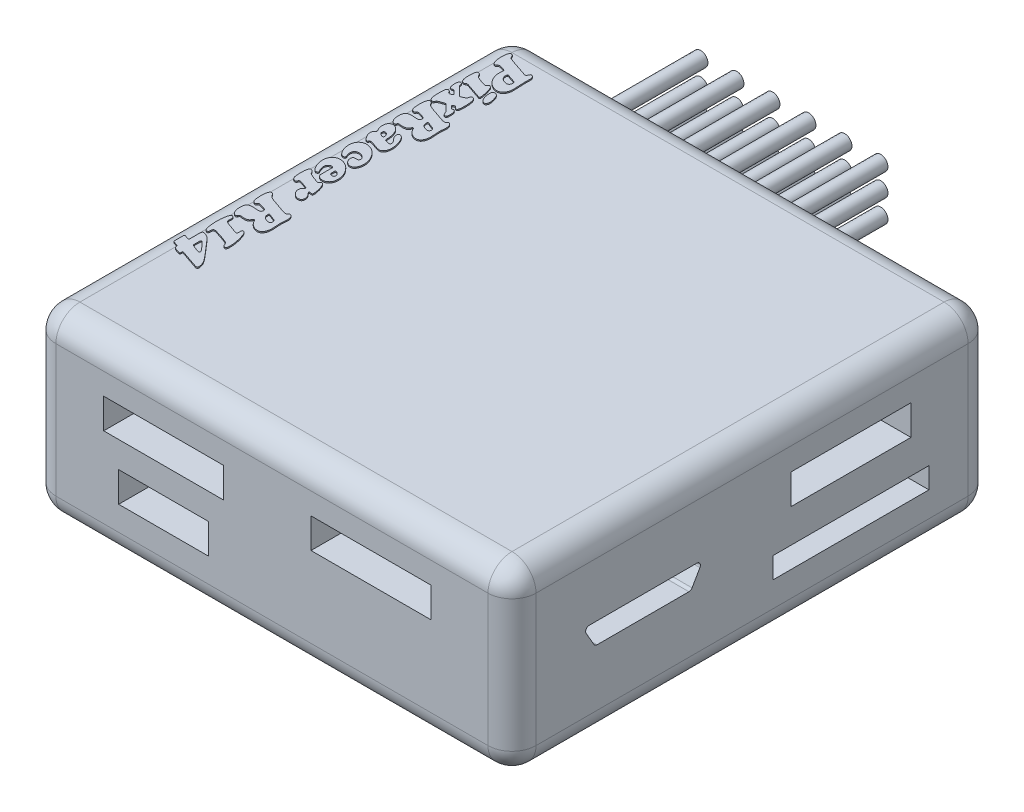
from build123d import *

# Parameters (mm, degrees)
IZIM1_W                        = 40
IZIM1_H                        = 15
Y_KSEKLIK_EKSTR_ZYON1_DEPTH    = 40
RADYUS1_R                      = 2
IZIM2_W                        = 10
IZIM2_H                        = 2.5
IZIM2_W_2                      = 7.5
KES_EKSTR_ZYON1_DEPTH          = 5
IZIM3_W                        = 18
IZIM3_H                        = 6
IZIM3_W_2                      = 10
IZIM3_H_2                      = 2.5
IZIM3_W_3                      = 7.5
KES_EKSTR_ZYON2_DEPTH          = 5
IZIM4_R                        = 0.6
Y_KSEKLIK_EKSTR_ZYON2_DEPTH    = 15
IZIM5_W                        = 12
IZIM5_H                        = 2.5
IZIM5_W_2                      = 8
IZIM5_W_3                      = 10
KES_EKSTR_ZYON3_DEPTH          = 5
IZIM6_W                        = 10
IZIM6_H                        = 2.5
IZIM6_W_2                      = 13
IZIM6_H_2                      = 1.75
KES_EKSTR_ZYON4_DEPTH          = 5
Y_KSEKLIK_EKSTR_ZYON4_DEPTH    = 0.1
Y_KSEKLIK_EKSTR_ZYON4_2_DEPTH  = 0.1
Y_KSEKLIK_EKSTR_ZYON4_3_DEPTH  = 0.1
Y_KSEKLIK_EKSTR_ZYON4_4_DEPTH  = 0.1
Y_KSEKLIK_EKSTR_ZYON4_5_DEPTH  = 0.1
Y_KSEKLIK_EKSTR_ZYON4_6_DEPTH  = 0.1
Y_KSEKLIK_EKSTR_ZYON4_7_DEPTH  = 0.1
Y_KSEKLIK_EKSTR_ZYON4_8_DEPTH  = 0.1
Y_KSEKLIK_EKSTR_ZYON4_9_DEPTH  = 0.1
Y_KSEKLIK_EKSTR_ZYON4_10_DEPTH = 0.1
Y_KSEKLIK_EKSTR_ZYON4_11_DEPTH = 0.1
Y_KSEKLIK_EKSTR_ZYON4_12_DEPTH = 0.1


with BuildPart() as part:
    # izim1 → Y_kseklik-Ekstr_zyon1 (new body)
    with BuildSketch(Plane.XY):
        with Locations((-17.399415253, -6.318301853)):
            Rectangle(IZIM1_W, IZIM1_H)
    extrude(amount=Y_KSEKLIK_EKSTR_ZYON1_DEPTH)

    # Radyus1
    radyus1_edges = [part.edges().sort_by_distance(p)[0] for p in [
        (2.600584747, -6.318301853, 40),
        (-17.399415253, 1.181698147, 40),
        (-37.399415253, -6.318301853, 40),
        (-17.399415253, 1.181698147, 0),
        (2.600584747, -6.318301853, 0),
        (-17.399415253, -13.818301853, 0),
        (-37.399415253, -6.318301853, 0),
        (-17.399415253, -13.818301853, 40),
        (-37.399415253, 1.181698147, 20),
        (2.600584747, 1.181698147, 20),
        (2.600584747, -13.818301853, 20),
        (-37.399415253, -13.818301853, 20),
    ]]
    fillet(radyus1_edges, radius=RADYUS1_R)

    # izim2 → Kes-Ekstr_zyon1 (cut)
    with BuildSketch(Plane.XY.offset(40)):
        with Locations((-26.415131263, -3.866426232)):
            Rectangle(IZIM2_W, IZIM2_H)
        with Locations((-26.415131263, -8.541160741)):
            Rectangle(IZIM2_W_2, IZIM2_H)
        with Locations((-9.143912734, -3.866426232)):
            Rectangle(IZIM2_W, IZIM2_H)
    extrude(amount=-KES_EKSTR_ZYON1_DEPTH, mode=Mode.SUBTRACT)

    # izim3 → Kes-Ekstr_zyon2 (cut)
    with BuildSketch(Plane(origin=(0, 0, 0), x_dir=(-1, 0, 0), z_dir=(0, 0, -1))):
        with Locations((24.47884411, -5.202813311)):
            Rectangle(IZIM3_W, IZIM3_H)
        with Locations((7.759647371, -3.868851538)):
            Rectangle(IZIM3_W_2, IZIM3_H_2)
        with Locations((7.759647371, -8.782265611)):
            Rectangle(IZIM3_W_3, IZIM3_H_2)
    extrude(amount=-KES_EKSTR_ZYON2_DEPTH, mode=Mode.SUBTRACT)

    # izim4 → Y_kseklik-Ekstr_zyon2 (add)
    with BuildSketch(Plane(origin=(0, 0, 5), x_dir=(-1, 0, 0), z_dir=(0, 0, -1))):
        with Locations((16.67884411, -3.402813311)):
            Circle(IZIM4_R)
        with Locations((19.67884411, -3.402813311)):
            Circle(IZIM4_R)
        with Locations((22.67884411, -3.402813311)):
            Circle(IZIM4_R)
        with Locations((25.67884411, -3.402813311)):
            Circle(IZIM4_R)
        with Locations((28.67884411, -3.402813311)):
            Circle(IZIM4_R)
        with Locations((31.67884411, -3.402813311)):
            Circle(IZIM4_R)
        with Locations((19.67884411, -5.302813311)):
            Circle(IZIM4_R)
        with Locations((22.67884411, -5.302813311)):
            Circle(IZIM4_R)
        with Locations((25.67884411, -5.302813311)):
            Circle(IZIM4_R)
        with Locations((28.67884411, -5.302813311)):
            Circle(IZIM4_R)
        with Locations((31.67884411, -5.302813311)):
            Circle(IZIM4_R)
        with Locations((19.67884411, -7.202813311)):
            Circle(IZIM4_R)
        with Locations((22.67884411, -7.202813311)):
            Circle(IZIM4_R)
        with Locations((25.67884411, -7.202813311)):
            Circle(IZIM4_R)
        with Locations((28.67884411, -7.202813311)):
            Circle(IZIM4_R)
        with Locations((31.67884411, -7.202813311)):
            Circle(IZIM4_R)
        with Locations((16.67884411, -5.302813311)):
            Circle(IZIM4_R)
        with Locations((16.67884411, -7.202813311)):
            Circle(IZIM4_R)
    extrude(amount=Y_KSEKLIK_EKSTR_ZYON2_DEPTH)

    # izim5 → Kes-Ekstr_zyon3 (cut)
    with BuildSketch(Plane.ZY.offset(37.399415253)):
        with Locations((11.412220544, -8.863986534)):
            Rectangle(IZIM5_W, IZIM5_H)
        with Locations((29.194261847, -3.940945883)):
            Rectangle(IZIM5_W_2, IZIM5_H)
        with Locations((29.194261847, -8.863986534)):
            Rectangle(IZIM5_W_3, IZIM5_H)
    extrude(amount=-KES_EKSTR_ZYON3_DEPTH, mode=Mode.SUBTRACT)

    # izim6 → Kes-Ekstr_zyon4 (cut)
    with BuildSketch(Plane(origin=(2.600584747, 0, 0), x_dir=(0, 0, -1), z_dir=(1, 0, 0))):
        with BuildLine():
            Line((-33.566002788, -5.355742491), (-24.605233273, -5.355742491))
            ThreePointArc((-24.605233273, -5.355742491), (-24.345425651, -5.505742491), (-24.345425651, -5.805742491))
            Line((-24.345425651, -5.805742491), (-24.99901549, -6.937793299))
            ThreePointArc((-24.99901549, -6.937793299), (-25.108823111, -7.04760092), (-25.258823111, -7.087793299))
            Line((-25.258823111, -7.087793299), (-32.91241295, -7.087793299))
            ThreePointArc((-32.91241295, -7.087793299), (-33.06241295, -7.04760092), (-33.172220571, -6.937793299))
            Line((-33.172220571, -6.937793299), (-33.825810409, -5.805742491))
            ThreePointArc((-33.825810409, -5.805742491), (-33.825810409, -5.505742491), (-33.566002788, -5.355742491))
        make_face()
        with Locations((-11.765144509, -3.950123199)):
            Rectangle(IZIM6_W, IZIM6_H)
        with Locations((-11.765144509, -8.858722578)):
            Rectangle(IZIM6_W_2, IZIM6_H_2)
    extrude(amount=-KES_EKSTR_ZYON4_DEPTH, mode=Mode.SUBTRACT)


with BuildPart() as body_2:
    # izim7 → Y_kseklik-Ekstr_zyon4 (new body)
    with BuildSketch(Plane(origin=(0, 1.181698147, 0), x_dir=(1, 0, 0), z_dir=(0, 1, 0))):
        with BuildLine():
            Line((-34.433107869, -2.751305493), (-33.356296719, -3.117048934))
            add(Edge.make_bspline(
                [(-33.356296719, -3.117048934), (-33.339699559, -3.122510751), (-33.308185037, -3.132881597), (-33.263144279, -3.146738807), (-33.222896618, -3.158135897), (-33.187558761, -3.167469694), (-33.156834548, -3.17342136), (-33.130782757, -3.177289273), (-33.109484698, -3.178625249), (-33.08687937, -3.177680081), (-33.061103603, -3.165776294), (-33.037675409, -3.136784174), (-33.015603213, -3.096646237), (-33.005699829, -3.064280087), (-33.000162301, -3.046182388)],
                knots=[0, 0, 0, 0, 1.430797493, 2.71678406, 3.858422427, 4.856376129, 5.708337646, 6.420064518, 7.011121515, 7.454944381, 8.262204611, 9.237000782, 10.455054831, 12, 12, 12, 12], degree=3))
            add(Edge.make_bspline(
                [(-33.000162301, -3.046182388), (-32.995718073, -3.032627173), (-32.987419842, -3.00731697), (-32.970413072, -2.973746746), (-32.951243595, -2.9464576), (-32.928903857, -2.926221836), (-32.903906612, -2.912882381), (-32.876390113, -2.906877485), (-32.846448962, -2.907391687), (-32.826703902, -2.913348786), (-32.816389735, -2.916460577)],
                knots=[0, 0, 0, 0, 1.324748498, 2.473561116, 3.486281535, 4.409139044, 5.250079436, 6.089989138, 7.002273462, 8, 8, 8, 8], degree=3))
            add(Edge.make_bspline(
                [(-32.816389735, -2.916460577), (-32.801657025, -2.922254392), (-32.77218686, -2.933843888), (-32.733656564, -2.962304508), (-32.700230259, -2.998002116), (-32.673678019, -3.04184567), (-32.651773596, -3.0922712), (-32.636497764, -3.149525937), (-32.62755156, -3.21325587), (-32.62653974, -3.257750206), (-32.626010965, -3.28100289)],
                knots=[0, 0, 0, 0, 0.860047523, 1.720372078, 2.585392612, 3.512188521, 4.499731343, 5.574846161, 6.732617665, 8, 8, 8, 8], degree=3))
            add(Edge.make_bspline(
                [(-32.626010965, -3.28100289), (-32.626239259, -3.29201269), (-32.626820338, -3.320036), (-32.626883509, -3.37090891), (-32.630143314, -3.439536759), (-32.631345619, -3.491196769), (-32.632016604, -3.520027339)],
                knots=[0, 0, 0, 0, 0.552659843, 1.406688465, 2.552717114, 4, 4, 4, 4], degree=3))
            Line((-32.632016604, -3.520027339), (-32.632016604, -3.64194182))
            add(Edge.make_bspline(
                [(-32.632016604, -3.64194182), (-32.63174287, -3.668566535), (-32.631224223, -3.719012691), (-32.631610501, -3.790282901), (-32.630913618, -3.852740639), (-32.630005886, -3.906387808), (-32.630438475, -3.951435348), (-32.629686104, -3.987869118), (-32.629072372, -4.015692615), (-32.62859936, -4.037731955), (-32.626811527, -4.060113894), (-32.626149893, -4.088989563), (-32.623279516, -4.127391), (-32.620449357, -4.175445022), (-32.616811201, -4.232897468), (-32.612572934, -4.29995806), (-32.607818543, -4.376433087), (-32.604395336, -4.430682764), (-32.602588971, -4.459309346)],
                knots=[0, 0, 0, 0, 1.562022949, 2.959582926, 4.181036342, 5.226336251, 6.107151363, 6.823643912, 7.364004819, 7.740002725, 8.11655047, 8.680761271, 9.433856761, 10.375226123, 11.504869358, 12.81106534, 14.317256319, 16, 16, 16, 16], degree=3))
            add(Edge.make_bspline(
                [(-32.602588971, -4.459309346), (-32.600041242, -4.497331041), (-32.59519038, -4.569724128), (-32.594098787, -4.642269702), (-32.593580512, -4.676713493)],
                knots=[0, 0, 0, 0, 1.050423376, 2, 2, 2, 2], degree=3))
            add(Edge.make_bspline(
                [(-32.593580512, -4.676713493), (-32.594148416, -4.703745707), (-32.595264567, -4.756874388), (-32.600865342, -4.834767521), (-32.612018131, -4.908680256), (-32.626134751, -4.979044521), (-32.645262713, -5.045523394), (-32.669030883, -5.108138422), (-32.695546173, -5.167705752), (-32.717711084, -5.204414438), (-32.728707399, -5.222626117)],
                knots=[0, 0, 0, 0, 1.138761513, 2.238103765, 3.286233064, 4.285009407, 5.259029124, 6.195540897, 7.104783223, 8, 8, 8, 8], degree=3))
            add(Edge.make_bspline(
                [(-32.728707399, -5.222626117), (-32.738460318, -5.237620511), (-32.75761057, -5.26706261), (-32.790252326, -5.307434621), (-32.825177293, -5.343416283), (-32.861724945, -5.375771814), (-32.901275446, -5.402581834), (-32.942179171, -5.42641454), (-32.985433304, -5.445645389), (-33.030989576, -5.460148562), (-33.078713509, -5.470102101), (-33.128466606, -5.477040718), (-33.180551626, -5.47849511), (-33.234550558, -5.476111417), (-33.290711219, -5.469273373), (-33.348977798, -5.458631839), (-33.40914437, -5.442589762), (-33.449634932, -5.429783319), (-33.470403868, -5.423214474)],
                knots=[0, 0, 0, 0, 1.02087215, 2.004523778, 2.958435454, 3.882144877, 4.785833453, 5.681898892, 6.582545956, 7.482685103, 8.406394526, 9.3634515, 10.347103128, 11.376895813, 12.447375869, 13.575098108, 14.756188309, 16, 16, 16, 16], degree=3))
            add(Edge.make_bspline(
                [(-33.470403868, -5.423214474), (-33.504093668, -5.410819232), (-33.570909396, -5.38623621), (-33.666153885, -5.338643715), (-33.756624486, -5.283915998), (-33.842090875, -5.22129229), (-33.922535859, -5.150773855), (-33.996674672, -5.071501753), (-34.067276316, -4.985495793), (-34.108737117, -4.922932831), (-34.129823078, -4.891114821)],
                knots=[0, 0, 0, 0, 0.996215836, 1.975757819, 2.951078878, 3.929547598, 4.914281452, 5.917036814, 6.940655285, 8, 8, 8, 8], degree=3))
            add(Edge.make_bspline(
                [(-34.129823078, -4.891114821), (-34.14823579, -4.860509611), (-34.184791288, -4.799747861), (-34.232162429, -4.705515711), (-34.271951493, -4.609716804), (-34.304262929, -4.512688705), (-34.33067105, -4.414567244), (-34.348293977, -4.314676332), (-34.359600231, -4.213539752), (-34.360959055, -4.145644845), (-34.36164076, -4.111582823)],
                knots=[0, 0, 0, 0, 1.039736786, 2.064231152, 3.067731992, 4.057596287, 5.040242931, 6.023546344, 7.008438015, 8, 8, 8, 8], degree=3))
            add(Edge.make_bspline(
                [(-34.36164076, -4.111582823), (-34.361606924, -4.093360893), (-34.361535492, -4.054891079), (-34.357934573, -3.99465252), (-34.354046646, -3.928951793), (-34.349955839, -3.883559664), (-34.347827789, -3.859946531)],
                knots=[0, 0, 0, 0, 0.867180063, 1.830775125, 2.871562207, 4, 4, 4, 4], degree=3))
            add(Edge.make_bspline(
                [(-34.347827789, -3.859946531), (-34.347144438, -3.848127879), (-34.34590449, -3.826682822), (-34.342744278, -3.798538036), (-34.342610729, -3.777461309), (-34.342048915, -3.766057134), (-34.341822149, -3.761454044)],
                knots=[0, 0, 0, 0, 1.439359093, 2.611730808, 3.439650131, 4, 4, 4, 4], degree=3))
            add(Edge.make_bspline(
                [(-34.341822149, -3.761454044), (-34.342558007, -3.752473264), (-34.343996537, -3.734916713), (-34.357796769, -3.71120794), (-34.380499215, -3.69324944), (-34.39901877, -3.68568875), (-34.409085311, -3.68157904)],
                knots=[0, 0, 0, 0, 0.95464529, 1.866238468, 2.840166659, 4, 4, 4, 4], degree=3))
            Line((-34.409085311, -3.68157904), (-34.421697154, -3.677375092))
            Line((-34.421697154, -3.677375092), (-34.761015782, -3.574078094))
            add(Edge.make_bspline(
                [(-34.761015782, -3.574078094), (-34.776557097, -3.569576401), (-34.80519411, -3.561281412), (-34.845661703, -3.554034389), (-34.879691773, -3.550962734), (-34.908977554, -3.553404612), (-34.934952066, -3.563761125), (-34.960575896, -3.579522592), (-34.985525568, -3.603743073), (-35.001241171, -3.622759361), (-35.009649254, -3.632933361)],
                knots=[0, 0, 0, 0, 1.384849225, 2.551775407, 3.514285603, 4.307554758, 5.039946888, 5.886798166, 6.869405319, 8, 8, 8, 8], degree=3))
            add(Edge.make_bspline(
                [(-35.009649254, -3.632933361), (-35.021234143, -3.646036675), (-35.042732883, -3.670353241), (-35.082532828, -3.694784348), (-35.125707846, -3.704021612), (-35.15305256, -3.697113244), (-35.166997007, -3.693590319)],
                knots=[0, 0, 0, 0, 1.157075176, 2.147250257, 3.055189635, 4, 4, 4, 4], degree=3))
            add(Edge.make_bspline(
                [(-35.166997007, -3.693590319), (-35.177811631, -3.689381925), (-35.199580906, -3.680910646), (-35.229094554, -3.660576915), (-35.257933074, -3.636810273), (-35.283328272, -3.606118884), (-35.307650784, -3.57106925), (-35.32957995, -3.530641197), (-35.350205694, -3.485147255), (-35.368625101, -3.434336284), (-35.384373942, -3.378606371), (-35.399171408, -3.318814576), (-35.410743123, -3.254560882), (-35.42109034, -3.186303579), (-35.428837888, -3.11376759), (-35.434146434, -3.03724294), (-35.43704974, -2.956320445), (-35.437579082, -2.901048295), (-35.437851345, -2.872619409)],
                knots=[0, 0, 0, 0, 0.611490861, 1.230899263, 1.88410846, 2.582086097, 3.327783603, 4.137851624, 5.009404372, 5.967001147, 6.99194935, 8.070108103, 9.222201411, 10.442110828, 11.719613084, 13.077700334, 14.496933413, 16, 16, 16, 16], degree=3))
            add(Edge.make_bspline(
                [(-35.437851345, -2.872619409), (-35.437600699, -2.843188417), (-35.437118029, -2.786512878), (-35.434011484, -2.704616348), (-35.429593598, -2.629062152), (-35.422240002, -2.559978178), (-35.41354197, -2.497178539), (-35.402203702, -2.44083851), (-35.388949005, -2.39072172), (-35.374602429, -2.34674848), (-35.356805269, -2.309712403), (-35.338014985, -2.278437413), (-35.316002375, -2.254043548), (-35.292472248, -2.235387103), (-35.266330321, -2.223340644), (-35.238054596, -2.218863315), (-35.207895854, -2.219847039), (-35.188129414, -2.225738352), (-35.177807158, -2.228814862)],
                knots=[0, 0, 0, 0, 1.788504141, 3.444139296, 4.98008754, 6.386724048, 7.665035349, 8.83172546, 9.876336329, 10.815057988, 11.63675189, 12.369216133, 13.023900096, 13.622490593, 14.18329561, 14.751311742, 15.347920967, 16, 16, 16, 16], degree=3))
            add(Edge.make_bspline(
                [(-35.177807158, -2.228814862), (-35.168082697, -2.232567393), (-35.149311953, -2.239810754), (-35.123888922, -2.254429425), (-35.101698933, -2.271274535), (-35.082452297, -2.292808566), (-35.063773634, -2.321531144), (-35.041404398, -2.359333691), (-35.016878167, -2.40931306), (-34.999381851, -2.446395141), (-34.989830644, -2.466638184)],
                knots=[0, 0, 0, 0, 0.797329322, 1.539053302, 2.238357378, 2.922193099, 3.738751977, 4.859024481, 6.285347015, 8, 8, 8, 8], degree=3))
            add(Edge.make_bspline(
                [(-34.989830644, -2.466638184), (-34.983070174, -2.479736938), (-34.970083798, -2.5048987), (-34.943794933, -2.537142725), (-34.915292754, -2.564993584), (-34.885658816, -2.582749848), (-34.855900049, -2.596004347), (-34.82401421, -2.609121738), (-34.782404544, -2.625430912), (-34.730893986, -2.644154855), (-34.67037651, -2.667494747), (-34.599619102, -2.692327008), (-34.519748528, -2.721326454), (-34.462964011, -2.740974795), (-34.433107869, -2.751305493)],
                knots=[0, 0, 0, 0, 0.825181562, 1.585114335, 2.324495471, 3.051127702, 3.508707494, 4.153574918, 4.986221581, 6.017392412, 7.23006712, 8.627017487, 10.2265545, 12, 12, 12, 12], degree=3))
        make_face()
        with BuildLine():
            Line((-33.129884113, -4.116387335), (-33.783297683, -3.89477924))
            add(Edge.make_bspline(
                [(-33.783297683, -3.89477924), (-33.794443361, -3.891118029), (-33.814044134, -3.88467943), (-33.840515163, -3.881813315), (-33.862370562, -3.884497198), (-33.869922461, -3.894019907), (-33.873382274, -3.898382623)],
                knots=[0, 0, 0, 0, 1.446323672, 2.543502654, 3.332722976, 4, 4, 4, 4], degree=3))
            add(Edge.make_bspline(
                [(-33.873382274, -3.898382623), (-33.877695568, -3.907273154), (-33.886810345, -3.926060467), (-33.894762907, -3.958662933), (-33.899362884, -3.995934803), (-33.90004642, -4.022482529), (-33.900407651, -4.03651233)],
                knots=[0, 0, 0, 0, 0.832390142, 1.758992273, 2.815684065, 4, 4, 4, 4], degree=3))
            add(Edge.make_bspline(
                [(-33.900407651, -4.03651233), (-33.899756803, -4.058427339), (-33.898465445, -4.101909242), (-33.883242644, -4.165420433), (-33.862552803, -4.227712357), (-33.84063752, -4.265840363), (-33.829541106, -4.285145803)],
                knots=[0, 0, 0, 0, 1.002469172, 1.989014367, 2.981773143, 4, 4, 4, 4], degree=3))
            add(Edge.make_bspline(
                [(-33.829541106, -4.285145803), (-33.820590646, -4.298743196), (-33.802573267, -4.326114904), (-33.770532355, -4.364167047), (-33.733506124, -4.39893649), (-33.692756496, -4.43133061), (-33.647748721, -4.461075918), (-33.598263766, -4.488007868), (-33.54451849, -4.512633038), (-33.506547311, -4.526248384), (-33.487219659, -4.533178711)],
                knots=[0, 0, 0, 0, 0.905123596, 1.822024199, 2.759459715, 3.726528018, 4.71497163, 5.756690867, 6.858136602, 8, 8, 8, 8], degree=3))
            add(Edge.make_bspline(
                [(-33.487219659, -4.533178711), (-33.46729546, -4.539513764), (-33.42903083, -4.551680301), (-33.372766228, -4.563876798), (-33.320617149, -4.569412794), (-33.272917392, -4.569399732), (-33.22936393, -4.562012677), (-33.19010406, -4.548970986), (-33.154596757, -4.529641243), (-33.135347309, -4.511606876), (-33.125680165, -4.50254995)],
                knots=[0, 0, 0, 0, 1.309278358, 2.51448274, 3.598865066, 4.589652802, 5.492663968, 6.353227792, 7.172984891, 8, 8, 8, 8], degree=3))
            add(Edge.make_bspline(
                [(-33.125680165, -4.50254995), (-33.114579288, -4.489387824), (-33.091930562, -4.462533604), (-33.070163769, -4.41209711), (-33.056655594, -4.35453698), (-33.055450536, -4.313461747), (-33.05481362, -4.291752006)],
                knots=[0, 0, 0, 0, 0.902466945, 1.841271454, 2.859034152, 4, 4, 4, 4], degree=3))
            add(Edge.make_bspline(
                [(-33.05481362, -4.291752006), (-33.055031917, -4.279934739), (-33.055447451, -4.257440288), (-33.058845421, -4.225617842), (-33.065095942, -4.197792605), (-33.072224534, -4.173296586), (-33.083525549, -4.153378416), (-33.095925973, -4.136330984), (-33.112010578, -4.124162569), (-33.123963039, -4.118963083), (-33.129884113, -4.116387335)],
                knots=[0, 0, 0, 0, 1.39598633, 2.657293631, 3.770471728, 4.765060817, 5.653956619, 6.462815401, 7.238501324, 8, 8, 8, 8], degree=3))
        make_face(mode=Mode.SUBTRACT)
    extrude(amount=Y_KSEKLIK_EKSTR_ZYON4_DEPTH)


with BuildPart() as body_3:
    # izim7 → Y_kseklik-Ekstr_zyon4 2 (new body)
    with BuildSketch(Plane(origin=(0, 1.181698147, 0), x_dir=(1, 0, 0), z_dir=(0, 1, 0))):
        with BuildLine():
            Line((-33.525655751, -6.672387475), (-34.699157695, -6.273613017))
            add(Edge.make_bspline(
                [(-34.699157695, -6.273613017), (-34.720705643, -6.266374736), (-34.76053164, -6.252996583), (-34.816265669, -6.237879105), (-34.862761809, -6.228294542), (-34.901320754, -6.224608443), (-34.934811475, -6.227099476), (-34.965668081, -6.234799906), (-34.995257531, -6.248967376), (-35.012680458, -6.262456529), (-35.021660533, -6.26940907)],
                knots=[0, 0, 0, 0, 1.60720728, 2.970521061, 4.081078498, 4.961643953, 5.69996752, 6.445046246, 7.198550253, 8, 8, 8, 8], degree=3))
            add(Edge.make_bspline(
                [(-35.021660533, -6.26940907), (-35.035026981, -6.279795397), (-35.058307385, -6.29788531), (-35.096598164, -6.315862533), (-35.13696309, -6.315121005), (-35.162768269, -6.307759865), (-35.177206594, -6.303641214)],
                knots=[0, 0, 0, 0, 1.203137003, 2.095509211, 2.934413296, 4, 4, 4, 4], degree=3))
            add(Edge.make_bspline(
                [(-35.177206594, -6.303641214), (-35.187950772, -6.29953652), (-35.209355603, -6.291359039), (-35.239255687, -6.273632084), (-35.266337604, -6.250738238), (-35.292274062, -6.224503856), (-35.315804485, -6.193579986), (-35.33653321, -6.158164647), (-35.356959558, -6.11932182), (-35.372950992, -6.074951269), (-35.38903208, -6.027115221), (-35.401809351, -5.974595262), (-35.41344528, -5.918163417), (-35.422133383, -5.85716003), (-35.429504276, -5.791891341), (-35.433984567, -5.722143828), (-35.437094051, -5.648253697), (-35.437594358, -5.597581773), (-35.437851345, -5.571553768)],
                knots=[0, 0, 0, 0, 0.671141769, 1.337066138, 2.01842251, 2.73795655, 3.488839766, 4.281117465, 5.133685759, 6.048105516, 7.031917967, 8.081453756, 9.203062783, 10.397263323, 11.67977387, 13.039673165, 14.479406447, 16, 16, 16, 16], degree=3))
            add(Edge.make_bspline(
                [(-35.437851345, -5.571553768), (-35.437871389, -5.543522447), (-35.437910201, -5.489243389), (-35.43436356, -5.410379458), (-35.430793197, -5.336416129), (-35.423788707, -5.267586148), (-35.416359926, -5.203819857), (-35.406661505, -5.145325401), (-35.395566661, -5.091721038), (-35.38599211, -5.058023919), (-35.381398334, -5.041856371)],
                knots=[0, 0, 0, 0, 1.25864604, 2.437206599, 3.544778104, 4.583358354, 5.543448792, 6.427272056, 7.245420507, 8, 8, 8, 8], degree=3))
            add(Edge.make_bspline(
                [(-35.381398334, -5.041856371), (-35.377757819, -5.03207499), (-35.370777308, -5.013319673), (-35.35480352, -4.988815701), (-35.335201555, -4.968793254), (-35.311455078, -4.954621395), (-35.285260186, -4.944746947), (-35.256784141, -4.94034519), (-35.226566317, -4.943209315), (-35.206756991, -4.948836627), (-35.19642464, -4.951771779)],
                knots=[0, 0, 0, 0, 1.075165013, 2.061576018, 2.997276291, 3.944104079, 4.892736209, 5.8752389, 6.891745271, 8, 8, 8, 8], degree=3))
            add(Edge.make_bspline(
                [(-35.19642464, -4.951771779), (-35.179931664, -4.958288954), (-35.148824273, -4.970580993), (-35.115463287, -4.998530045), (-35.092276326, -5.029306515), (-35.07057146, -5.062816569), (-35.044057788, -5.106841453), (-35.025737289, -5.140075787), (-35.015654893, -5.158365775)],
                knots=[0, 0, 0, 0, 1.125392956, 2.122602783, 2.72283288, 3.579809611, 4.668086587, 6, 6, 6, 6], degree=3))
            add(Edge.make_bspline(
                [(-35.015654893, -5.158365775), (-35.007017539, -5.172050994), (-34.989359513, -5.20002877), (-34.95468423, -5.238198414), (-34.913265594, -5.274221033), (-34.862990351, -5.30776182), (-34.802870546, -5.340576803), (-34.730761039, -5.372996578), (-34.646166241, -5.40675352), (-34.585143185, -5.428069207), (-34.552620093, -5.439429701)],
                knots=[0, 0, 0, 0, 0.700983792, 1.4330766, 2.227246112, 3.077606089, 4.049427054, 5.195917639, 6.505525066, 8, 8, 8, 8], degree=3))
            add(Edge.make_bspline(
                [(-34.552620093, -5.439429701), (-34.53922492, -5.443888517), (-34.50774456, -5.454367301), (-34.452749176, -5.470938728), (-34.383547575, -5.491965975), (-34.318018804, -5.511163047), (-34.262999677, -5.527289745), (-34.224598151, -5.538236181), (-34.190580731, -5.546972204), (-34.161694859, -5.555485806), (-34.137501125, -5.562214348), (-34.118035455, -5.567046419), (-34.103380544, -5.570480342), (-34.095188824, -5.572547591), (-34.091987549, -5.57335546)],
                knots=[0, 0, 0, 0, 1.059241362, 2.489351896, 4.309318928, 6.486106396, 7.612647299, 8.611259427, 9.48206251, 10.247521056, 10.870647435, 11.366097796, 11.75227482, 12, 12, 12, 12], degree=3))
            add(Edge.make_bspline(
                [(-34.091987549, -5.57335546), (-34.07888905, -5.574834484), (-34.053813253, -5.57766593), (-34.017178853, -5.563957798), (-33.986663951, -5.537079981), (-33.972753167, -5.512637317), (-33.965268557, -5.499486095)],
                knots=[0, 0, 0, 0, 0.984574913, 1.884872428, 2.861968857, 4, 4, 4, 4], degree=3))
            add(Edge.make_bspline(
                [(-33.965268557, -5.499486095), (-33.960701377, -5.490934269), (-33.951960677, -5.474567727), (-33.935755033, -5.453454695), (-33.917965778, -5.43675008), (-33.898656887, -5.424094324), (-33.876796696, -5.417706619), (-33.853776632, -5.415130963), (-33.829149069, -5.417871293), (-33.812863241, -5.422557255), (-33.804317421, -5.425016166)],
                knots=[0, 0, 0, 0, 1.174761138, 2.24826577, 3.210523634, 4.12694802, 5.017920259, 5.945856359, 6.922109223, 8, 8, 8, 8], degree=3))
            add(Edge.make_bspline(
                [(-33.804317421, -5.425016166), (-33.793785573, -5.429147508), (-33.772633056, -5.437445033), (-33.742849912, -5.455002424), (-33.716057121, -5.477775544), (-33.69000479, -5.503625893), (-33.667862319, -5.535269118), (-33.646442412, -5.57039772), (-33.627249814, -5.609990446), (-33.616884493, -5.638513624), (-33.611536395, -5.653230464)],
                knots=[0, 0, 0, 0, 0.876322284, 1.760035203, 2.664227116, 3.59713482, 4.596729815, 5.648119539, 6.786522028, 8, 8, 8, 8], degree=3))
            add(Edge.make_bspline(
                [(-33.611536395, -5.653230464), (-33.583436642, -5.739797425), (-33.526472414, -5.915287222), (-33.477319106, -6.116954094), (-33.448315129, -6.251695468), (-33.435770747, -6.314772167), (-33.424593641, -6.373545), (-33.41668226, -6.42814769), (-33.408917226, -6.478271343), (-33.404110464, -6.524166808), (-33.40182191, -6.565866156), (-33.401086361, -6.592110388), (-33.400738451, -6.60452375)],
                knots=[0, 0, 0, 0, 2.7932993, 5.662616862, 6.36656263, 7.024641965, 7.636996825, 8.202836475, 8.718234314, 9.194001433, 9.618767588, 10, 10, 10, 10], degree=3))
            add(Edge.make_bspline(
                [(-33.400738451, -6.60452375), (-33.400949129, -6.612982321), (-33.401337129, -6.628560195), (-33.407406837, -6.649552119), (-33.417066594, -6.666341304), (-33.43177084, -6.677692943), (-33.450323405, -6.683566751), (-33.472312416, -6.685315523), (-33.498078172, -6.681028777), (-33.51591973, -6.675438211), (-33.525655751, -6.672387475)],
                knots=[0, 0, 0, 0, 1.132404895, 2.085513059, 2.906536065, 3.691992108, 4.516969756, 5.488491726, 6.629486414, 8, 8, 8, 8], degree=3))
        make_face()
    extrude(amount=Y_KSEKLIK_EKSTR_ZYON4_2_DEPTH)


with BuildPart() as body_4:
    # izim7 → Y_kseklik-Ekstr_zyon4 3 (new body)
    with BuildSketch(Plane(origin=(0, 1.181698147, 0), x_dir=(1, 0, 0), z_dir=(0, 1, 0))):
        with BuildLine():
            add(Edge.make_bspline(
                [(-32.632016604, -6.590710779), (-32.632744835, -6.618178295), (-32.634109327, -6.669644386), (-32.645965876, -6.741210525), (-32.667753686, -6.800841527), (-32.696652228, -6.848886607), (-32.734105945, -6.883799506), (-32.779316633, -6.902907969), (-32.830653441, -6.905600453), (-32.864409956, -6.896080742), (-32.882451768, -6.890992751)],
                knots=[0, 0, 0, 0, 1.395954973, 2.615611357, 3.668489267, 4.605858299, 5.441668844, 6.226027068, 7.051866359, 8, 8, 8, 8], degree=3))
            add(Edge.make_bspline(
                [(-32.882451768, -6.890992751), (-32.895625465, -6.886139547), (-32.922105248, -6.876384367), (-32.959049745, -6.855265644), (-32.99513021, -6.831629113), (-33.027763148, -6.801941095), (-33.060311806, -6.770078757), (-33.088439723, -6.731949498), (-33.116891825, -6.691364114), (-33.132613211, -6.661376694), (-33.140694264, -6.645962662)],
                knots=[0, 0, 0, 0, 0.921142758, 1.851542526, 2.789448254, 3.749970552, 4.745541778, 5.777237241, 6.857463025, 8, 8, 8, 8], degree=3))
            add(Edge.make_bspline(
                [(-33.140694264, -6.645962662), (-33.152224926, -6.621075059), (-33.175372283, -6.571114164), (-33.204293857, -6.493692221), (-33.229890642, -6.41487449), (-33.250302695, -6.334218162), (-33.265738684, -6.25173774), (-33.277324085, -6.167583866), (-33.283904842, -6.081538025), (-33.284918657, -6.023588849), (-33.285430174, -5.994350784)],
                knots=[0, 0, 0, 0, 0.977504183, 1.962301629, 2.944068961, 3.930674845, 4.92583873, 5.934120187, 6.957667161, 8, 8, 8, 8], degree=3))
            add(Edge.make_bspline(
                [(-33.285430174, -5.994350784), (-33.284859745, -5.971071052), (-33.283799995, -5.927821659), (-33.273126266, -5.86784612), (-33.255384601, -5.817283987), (-33.236179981, -5.790231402), (-33.227175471, -5.777547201)],
                knots=[0, 0, 0, 0, 1.219965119, 2.266467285, 3.18719493, 4, 4, 4, 4], degree=3))
            add(Edge.make_bspline(
                [(-33.227175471, -5.777547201), (-33.220779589, -5.770334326), (-33.208319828, -5.75628299), (-33.186518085, -5.739106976), (-33.162450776, -5.727162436), (-33.137099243, -5.718288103), (-33.109553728, -5.71499078), (-33.08046611, -5.715696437), (-33.049563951, -5.72056426), (-33.028923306, -5.726837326), (-33.018179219, -5.730102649)],
                knots=[0, 0, 0, 0, 1.005075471, 1.957978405, 2.873736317, 3.798743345, 4.747284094, 5.750403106, 6.829015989, 8, 8, 8, 8], degree=3))
            add(Edge.make_bspline(
                [(-33.018179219, -5.730102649), (-33.003320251, -5.735805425), (-32.973387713, -5.747293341), (-32.932079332, -5.77429175), (-32.893100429, -5.807486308), (-32.855833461, -5.847423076), (-32.823022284, -5.895520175), (-32.790383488, -5.949114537), (-32.762181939, -6.010752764), (-32.745284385, -6.054515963), (-32.73651473, -6.077228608)],
                knots=[0, 0, 0, 0, 0.824461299, 1.660829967, 2.545974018, 3.480238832, 4.48688515, 5.563709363, 6.735590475, 8, 8, 8, 8], degree=3))
            add(Edge.make_bspline(
                [(-32.73651473, -6.077228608), (-32.720629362, -6.124069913), (-32.690096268, -6.214103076), (-32.656858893, -6.346909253), (-32.636395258, -6.471561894), (-32.63343898, -6.552006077), (-32.632016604, -6.590710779)],
                knots=[0, 0, 0, 0, 1.12712537, 2.166435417, 3.117803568, 4, 4, 4, 4], degree=3))
        make_face()
    extrude(amount=Y_KSEKLIK_EKSTR_ZYON4_3_DEPTH)


with BuildPart() as body_5:
    # izim7 → Y_kseklik-Ekstr_zyon4 4 (new body)
    with BuildSketch(Plane(origin=(0, 1.181698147, 0), x_dir=(1, 0, 0), z_dir=(0, 1, 0))):
        with BuildLine():
            Line((-34.26735222, -7.439908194), (-34.049948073, -7.341415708))
            add(Edge.make_bspline(
                [(-34.049948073, -7.341415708), (-34.028706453, -7.331206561), (-33.990178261, -7.312689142), (-33.941165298, -7.282377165), (-33.905482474, -7.253510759), (-33.877812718, -7.212008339), (-33.860370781, -7.151486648), (-33.847061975, -7.102356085), (-33.839750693, -7.075365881)],
                knots=[0, 0, 0, 0, 1.177335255, 2.135458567, 2.880299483, 3.449452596, 4.598839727, 6, 6, 6, 6], degree=3))
            add(Edge.make_bspline(
                [(-33.839750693, -7.075365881), (-33.836584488, -7.063597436), (-33.830666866, -7.041602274), (-33.815875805, -7.012941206), (-33.798847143, -6.989983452), (-33.779039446, -6.972187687), (-33.754823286, -6.962639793), (-33.728611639, -6.958380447), (-33.699240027, -6.960371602), (-33.679700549, -6.966415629), (-33.669190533, -6.969666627)],
                knots=[0, 0, 0, 0, 1.246068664, 2.328895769, 3.280965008, 4.16897, 5.0149712, 5.908882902, 6.875216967, 8, 8, 8, 8], degree=3))
            add(Edge.make_bspline(
                [(-33.669190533, -6.969666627), (-33.657965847, -6.974053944), (-33.635275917, -6.982922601), (-33.604555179, -7.004334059), (-33.575328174, -7.030209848), (-33.548830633, -7.062558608), (-33.525094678, -7.100788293), (-33.502654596, -7.144234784), (-33.482989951, -7.19376712), (-33.465849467, -7.249290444), (-33.450140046, -7.310572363), (-33.437114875, -7.378402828), (-33.425969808, -7.452356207), (-33.416151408, -7.532832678), (-33.40914825, -7.619587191), (-33.404559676, -7.712924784), (-33.401494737, -7.812638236), (-33.400995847, -7.8813203), (-33.400738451, -7.916755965)],
                knots=[0, 0, 0, 0, 0.558978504, 1.129936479, 1.730231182, 2.371886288, 3.067026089, 3.821082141, 4.644447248, 5.542996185, 6.523509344, 7.58672759, 8.755270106, 10.003099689, 11.358394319, 12.804143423, 14.351137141, 16, 16, 16, 16], degree=3))
            add(Edge.make_bspline(
                [(-33.400738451, -7.916755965), (-33.400925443, -7.942379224), (-33.401284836, -7.991626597), (-33.402016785, -8.062928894), (-33.405418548, -8.128571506), (-33.40866712, -8.189076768), (-33.413703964, -8.243903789), (-33.418599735, -8.293490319), (-33.425965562, -8.337302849), (-33.431687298, -8.364593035), (-33.434370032, -8.377388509)],
                knots=[0, 0, 0, 0, 1.329150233, 2.554599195, 3.697982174, 4.738216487, 5.697118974, 6.553693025, 7.321874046, 8, 8, 8, 8], degree=3))
            add(Edge.make_bspline(
                [(-33.434370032, -8.377388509), (-33.437866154, -8.389505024), (-33.444419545, -8.412217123), (-33.45822032, -8.442657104), (-33.474426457, -8.46723728), (-33.493150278, -8.48605231), (-33.515276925, -8.498092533), (-33.539772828, -8.503319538), (-33.566803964, -8.502757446), (-33.584599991, -8.497376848), (-33.594120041, -8.494498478)],
                knots=[0, 0, 0, 0, 1.315680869, 2.466210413, 3.475075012, 4.37689805, 5.209427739, 6.066528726, 6.965682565, 8, 8, 8, 8], degree=3))
            add(Edge.make_bspline(
                [(-33.594120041, -8.494498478), (-33.603101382, -8.489967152), (-33.624844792, -8.478997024), (-33.658149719, -8.450904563), (-33.698740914, -8.41112491), (-33.727241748, -8.379388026), (-33.743059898, -8.361773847)],
                knots=[0, 0, 0, 0, 0.599714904, 1.451881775, 2.585777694, 4, 4, 4, 4], degree=3))
            add(Edge.make_bspline(
                [(-33.743059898, -8.361773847), (-33.749518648, -8.355252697), (-33.761710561, -8.342942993), (-33.777618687, -8.336143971), (-33.785099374, -8.332946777)],
                knots=[0, 0, 0, 0, 1.059513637, 2, 2, 2, 2], degree=3))
            add(Edge.make_bspline(
                [(-33.785099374, -8.332946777), (-33.7930762, -8.331099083), (-33.810514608, -8.327059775), (-33.840018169, -8.330955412), (-33.873921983, -8.339109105), (-33.909090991, -8.354873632), (-33.942700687, -8.37073069), (-33.967856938, -8.388544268), (-33.985986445, -8.405167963), (-33.988737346, -8.418597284), (-33.989891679, -8.424232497)],
                knots=[0, 0, 0, 0, 0.815891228, 1.783647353, 2.943424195, 4.312775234, 5.642643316, 6.651651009, 7.43420575, 8, 8, 8, 8], degree=3))
            add(Edge.make_bspline(
                [(-33.989891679, -8.424232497), (-33.988244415, -8.431776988), (-33.984112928, -8.450699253), (-33.964391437, -8.480447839), (-33.934456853, -8.51747129), (-33.896419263, -8.5599248), (-33.855684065, -8.600807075), (-33.818323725, -8.634189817), (-33.78766098, -8.658212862), (-33.767628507, -8.667706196), (-33.759275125, -8.671664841)],
                knots=[0, 0, 0, 0, 0.534440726, 1.340425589, 2.442357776, 3.864376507, 5.303925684, 6.459599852, 7.357665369, 8, 8, 8, 8], degree=3))
            add(Edge.make_bspline(
                [(-33.759275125, -8.671664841), (-33.753499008, -8.673207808), (-33.740690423, -8.676629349), (-33.718863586, -8.673956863), (-33.693142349, -8.670351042), (-33.675320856, -8.664209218), (-33.66558715, -8.66085469)],
                knots=[0, 0, 0, 0, 0.742705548, 1.646955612, 2.714819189, 4, 4, 4, 4], degree=3))
            add(Edge.make_bspline(
                [(-33.66558715, -8.66085469), (-33.656811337, -8.658329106), (-33.640600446, -8.653663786), (-33.617380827, -8.648887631), (-33.596858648, -8.648461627), (-33.584675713, -8.651608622), (-33.579105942, -8.653047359)],
                knots=[0, 0, 0, 0, 1.242004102, 2.294259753, 3.220172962, 4, 4, 4, 4], degree=3))
            add(Edge.make_bspline(
                [(-33.579105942, -8.653047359), (-33.564371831, -8.660111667), (-33.532270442, -8.675502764), (-33.493260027, -8.71654621), (-33.456659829, -8.764254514), (-33.441758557, -8.802327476), (-33.434370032, -8.821205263)],
                knots=[0, 0, 0, 0, 0.853533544, 1.859604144, 2.938723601, 4, 4, 4, 4], degree=3))
            add(Edge.make_bspline(
                [(-33.434370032, -8.821205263), (-33.428694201, -8.840922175), (-33.416125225, -8.884584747), (-33.406816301, -8.959112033), (-33.400111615, -9.047486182), (-33.399347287, -9.111257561), (-33.398936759, -9.145509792)],
                knots=[0, 0, 0, 0, 0.751073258, 1.663231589, 2.744898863, 4, 4, 4, 4], degree=3))
            add(Edge.make_bspline(
                [(-33.398936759, -9.145509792), (-33.399327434, -9.174567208), (-33.400034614, -9.227165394), (-33.406450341, -9.297984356), (-33.415976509, -9.353594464), (-33.429293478, -9.383286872), (-33.434970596, -9.395944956)],
                knots=[0, 0, 0, 0, 1.366468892, 2.473509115, 3.349246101, 4, 4, 4, 4], degree=3))
            add(Edge.make_bspline(
                [(-33.434970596, -9.395944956), (-33.443842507, -9.408054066), (-33.460514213, -9.430808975), (-33.496812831, -9.453578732), (-33.53983581, -9.458664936), (-33.567842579, -9.45104027), (-33.582709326, -9.446992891)],
                knots=[0, 0, 0, 0, 1.049116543, 1.971453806, 2.923193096, 4, 4, 4, 4], degree=3))
            add(Edge.make_bspline(
                [(-33.582709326, -9.446992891), (-33.598328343, -9.440610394), (-33.628209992, -9.428399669), (-33.658349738, -9.397973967), (-33.676643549, -9.364055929), (-33.695579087, -9.327528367), (-33.716437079, -9.278194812), (-33.731677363, -9.241407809), (-33.740057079, -9.221180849)],
                knots=[0, 0, 0, 0, 1.056670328, 2.021577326, 2.621841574, 3.486396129, 4.617920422, 6, 6, 6, 6], degree=3))
            add(Edge.make_bspline(
                [(-33.740057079, -9.221180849), (-33.749965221, -9.198793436), (-33.768403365, -9.157132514), (-33.79782975, -9.113842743), (-33.822044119, -9.085201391), (-33.842152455, -9.06320878), (-33.868082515, -9.032960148), (-33.902276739, -8.99661204), (-33.942377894, -8.951865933), (-33.989517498, -8.899735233), (-34.044589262, -8.841051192), (-34.083028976, -8.799030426), (-34.103398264, -8.776763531)],
                knots=[0, 0, 0, 0, 1.27099547, 2.365205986, 2.705064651, 3.221137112, 3.914428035, 4.776387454, 5.815489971, 7.038743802, 8.430823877, 10, 10, 10, 10], degree=3))
            Line((-34.103398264, -8.776763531), (-34.314196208, -8.565365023))
            add(Edge.make_bspline(
                [(-34.314196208, -8.565365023), (-34.319317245, -8.559870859), (-34.328500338, -8.550018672), (-34.341673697, -8.538162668), (-34.351893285, -8.529691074), (-34.358388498, -8.526450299), (-34.361040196, -8.525127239)],
                knots=[0, 0, 0, 0, 1.450295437, 2.600683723, 3.428723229, 4, 4, 4, 4], degree=3))
            add(Edge.make_bspline(
                [(-34.361040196, -8.525127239), (-34.366065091, -8.524945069), (-34.381183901, -8.524396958), (-34.395754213, -8.528796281), (-34.405481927, -8.531733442)],
                knots=[0, 0, 0, 0, 0.664721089, 2, 2, 2, 2], degree=3))
            Line((-34.405481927, -8.531733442), (-34.589855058, -8.591189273))
            add(Edge.make_bspline(
                [(-34.589855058, -8.591189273), (-34.613121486, -8.598866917), (-34.65743842, -8.613490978), (-34.720089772, -8.636411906), (-34.775583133, -8.658403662), (-34.823985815, -8.679353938), (-34.865039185, -8.699573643), (-34.898853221, -8.719548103), (-34.92622832, -8.73796377), (-34.940341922, -8.751952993), (-34.94659004, -8.758146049)],
                knots=[0, 0, 0, 0, 1.481999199, 2.82285103, 4.034916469, 5.092355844, 6.013016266, 6.800150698, 7.468824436, 8, 8, 8, 8], degree=3))
            add(Edge.make_bspline(
                [(-34.94659004, -8.758146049), (-34.952043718, -8.764913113), (-34.964156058, -8.779942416), (-34.983189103, -8.806022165), (-35.002804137, -8.839252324), (-35.017418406, -8.863070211), (-35.025263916, -8.875856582)],
                knots=[0, 0, 0, 0, 0.735770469, 1.634108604, 2.729897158, 4, 4, 4, 4], degree=3))
            add(Edge.make_bspline(
                [(-35.025263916, -8.875856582), (-35.03300467, -8.887371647), (-35.047897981, -8.909526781), (-35.085359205, -8.928014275), (-35.129480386, -8.931108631), (-35.159148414, -8.922573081), (-35.175404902, -8.917896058)],
                knots=[0, 0, 0, 0, 0.959484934, 1.846061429, 2.819757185, 4, 4, 4, 4], degree=3))
            add(Edge.make_bspline(
                [(-35.175404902, -8.917896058), (-35.187579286, -8.913234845), (-35.211671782, -8.904010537), (-35.244916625, -8.884132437), (-35.276051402, -8.861035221), (-35.302726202, -8.832011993), (-35.328093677, -8.800295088), (-35.348636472, -8.76297827), (-35.367461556, -8.722152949), (-35.383224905, -8.676061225), (-35.396255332, -8.623781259), (-35.407639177, -8.563827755), (-35.416953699, -8.49565573), (-35.42465534, -8.419333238), (-35.430629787, -8.335014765), (-35.434475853, -8.242486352), (-35.437901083, -8.14159156), (-35.437868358, -8.071504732), (-35.437851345, -8.035067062)],
                knots=[0, 0, 0, 0, 0.63948817, 1.265515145, 1.897160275, 2.537329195, 3.19656734, 3.888471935, 4.623714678, 5.404665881, 6.2780037, 7.269768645, 8.402325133, 9.658315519, 11.039183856, 12.555843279, 14.209406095, 16, 16, 16, 16], degree=3))
            add(Edge.make_bspline(
                [(-35.437851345, -8.035067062), (-35.437764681, -8.007239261), (-35.437598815, -7.953979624), (-35.435574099, -7.877709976), (-35.433409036, -7.808220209), (-35.429897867, -7.745737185), (-35.425198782, -7.68983905), (-35.419075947, -7.641017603), (-35.413054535, -7.598783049), (-35.406987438, -7.573401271), (-35.404219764, -7.561822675)],
                knots=[0, 0, 0, 0, 1.404905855, 2.688849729, 3.851854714, 4.914818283, 5.848168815, 6.683080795, 7.399251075, 8, 8, 8, 8], degree=3))
            add(Edge.make_bspline(
                [(-35.404219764, -7.561822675), (-35.400199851, -7.548867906), (-35.392699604, -7.524697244), (-35.376388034, -7.492563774), (-35.356389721, -7.46732508), (-35.333045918, -7.448646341), (-35.306228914, -7.436546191), (-35.275974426, -7.432866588), (-35.242633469, -7.435285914), (-35.220343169, -7.442213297), (-35.208435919, -7.445913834)],
                knots=[0, 0, 0, 0, 1.230282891, 2.295428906, 3.252208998, 4.132347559, 4.98695837, 5.886777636, 6.871138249, 8, 8, 8, 8], degree=3))
            add(Edge.make_bspline(
                [(-35.208435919, -7.445913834), (-35.193998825, -7.451795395), (-35.164585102, -7.463778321), (-35.127278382, -7.496249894), (-35.093808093, -7.537261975), (-35.077651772, -7.57021486), (-35.069105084, -7.587646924)],
                knots=[0, 0, 0, 0, 0.909463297, 1.852914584, 2.864192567, 4, 4, 4, 4], degree=3))
            add(Edge.make_bspline(
                [(-35.069105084, -7.587646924), (-35.064070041, -7.597291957), (-35.054228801, -7.616143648), (-35.033100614, -7.640366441), (-35.006867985, -7.659229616), (-34.986826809, -7.667508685), (-34.976618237, -7.671725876)],
                knots=[0, 0, 0, 0, 1.013199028, 1.980347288, 2.971229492, 4, 4, 4, 4], degree=3))
            add(Edge.make_bspline(
                [(-34.976618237, -7.671725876), (-34.968820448, -7.673095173), (-34.94985317, -7.676425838), (-34.915958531, -7.670744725), (-34.87215151, -7.661343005), (-34.82253998, -7.644872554), (-34.77304465, -7.627983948), (-34.735597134, -7.606609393), (-34.707223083, -7.587261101), (-34.701157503, -7.569455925), (-34.698557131, -7.561822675)],
                knots=[0, 0, 0, 0, 0.604141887, 1.469509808, 2.602780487, 4.051013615, 5.480707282, 6.588057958, 7.394686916, 8, 8, 8, 8], degree=3))
            add(Edge.make_bspline(
                [(-34.698557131, -7.561822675), (-34.698747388, -7.557577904), (-34.699197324, -7.547539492), (-34.706029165, -7.531465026), (-34.717326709, -7.512648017), (-34.732858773, -7.490797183), (-34.75292377, -7.465767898), (-34.778546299, -7.438623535), (-34.807506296, -7.40714261), (-34.84111004, -7.374855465), (-34.874965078, -7.342215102), (-34.908110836, -7.312902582), (-34.938450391, -7.287024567), (-34.96543708, -7.263671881), (-34.991682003, -7.24607657), (-35.014306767, -7.231009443), (-35.034126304, -7.218745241), (-35.047398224, -7.213912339), (-35.053490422, -7.211693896)],
                knots=[0, 0, 0, 0, 0.398885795, 0.943320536, 1.62114951, 2.476246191, 3.471441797, 4.649276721, 6.000311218, 7.51125747, 9.049409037, 10.442272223, 11.689263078, 12.81748248, 13.808898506, 14.668998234, 15.389031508, 16, 16, 16, 16], degree=3))
            add(Edge.make_bspline(
                [(-35.053490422, -7.211693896), (-35.059864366, -7.210115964), (-35.073310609, -7.206787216), (-35.096008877, -7.209571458), (-35.121294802, -7.216902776), (-35.138481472, -7.225214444), (-35.147778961, -7.229710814)],
                knots=[0, 0, 0, 0, 0.794858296, 1.676804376, 2.743218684, 4, 4, 4, 4], degree=3))
            add(Edge.make_bspline(
                [(-35.147778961, -7.229710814), (-35.156244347, -7.23373245), (-35.173009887, -7.241697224), (-35.200853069, -7.246291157), (-35.229928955, -7.245144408), (-35.248949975, -7.239739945), (-35.25888329, -7.236917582)],
                knots=[0, 0, 0, 0, 0.977348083, 1.935619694, 2.921922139, 4, 4, 4, 4], degree=3))
            add(Edge.make_bspline(
                [(-35.25888329, -7.236917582), (-35.273363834, -7.230667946), (-35.30265683, -7.218025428), (-35.339425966, -7.183784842), (-35.371144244, -7.139972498), (-35.394845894, -7.083857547), (-35.414834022, -7.018124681), (-35.42791265, -6.941060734), (-35.436280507, -6.853144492), (-35.43730752, -6.790721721), (-35.437851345, -6.757667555)],
                knots=[0, 0, 0, 0, 0.694400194, 1.404716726, 2.192742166, 3.078326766, 4.088804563, 5.233969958, 6.535329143, 8, 8, 8, 8], degree=3))
            add(Edge.make_bspline(
                [(-35.437851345, -6.757667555), (-35.437834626, -6.73944419), (-35.437802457, -6.704381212), (-35.434832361, -6.654166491), (-35.432687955, -6.60816679), (-35.426679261, -6.567022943), (-35.421198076, -6.529989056), (-35.413390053, -6.49769489), (-35.404392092, -6.46975863), (-35.391746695, -6.439604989), (-35.370605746, -6.409710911), (-35.335262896, -6.386970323), (-35.291649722, -6.382872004), (-35.263111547, -6.390659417), (-35.247472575, -6.394926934)],
                knots=[0, 0, 0, 0, 1.343116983, 2.584247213, 3.708328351, 4.735300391, 5.64759424, 6.467329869, 7.181409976, 7.809302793, 8.87489268, 9.829195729, 10.810395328, 12, 12, 12, 12], degree=3))
            add(Edge.make_bspline(
                [(-35.247472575, -6.394926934), (-35.237362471, -6.39868435), (-35.218007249, -6.405877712), (-35.19171409, -6.420145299), (-35.170401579, -6.437935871), (-35.15266621, -6.458522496), (-35.138953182, -6.483723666), (-35.125898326, -6.513439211), (-35.116363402, -6.549808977), (-35.111005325, -6.576073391), (-35.10814174, -6.590110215)],
                knots=[0, 0, 0, 0, 1.013130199, 1.939580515, 2.794709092, 3.60891669, 4.476985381, 5.479933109, 6.653168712, 8, 8, 8, 8], degree=3))
            add(Edge.make_bspline(
                [(-35.10814174, -6.590110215), (-35.104933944, -6.605432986), (-35.098659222, -6.635405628), (-35.082713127, -6.677760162), (-35.062320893, -6.716795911), (-35.039180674, -6.747726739), (-35.013095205, -6.775515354), (-34.983648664, -6.806130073), (-34.94396093, -6.846323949), (-34.894089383, -6.895945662), (-34.834624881, -6.955796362), (-34.764492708, -7.024393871), (-34.684277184, -7.102723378), (-34.627679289, -7.15823209), (-34.597662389, -7.187671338)],
                knots=[0, 0, 0, 0, 0.706230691, 1.381447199, 2.036753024, 2.689621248, 3.118442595, 3.757961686, 4.608376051, 5.669765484, 6.935760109, 8.419202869, 10.100911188, 12, 12, 12, 12], degree=3))
            Line((-34.597662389, -7.187671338), (-34.356235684, -7.415285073))
            add(Edge.make_bspline(
                [(-34.356235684, -7.415285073), (-34.347906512, -7.424129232), (-34.334732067, -7.438118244), (-34.31796172, -7.447330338), (-34.311793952, -7.450718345)],
                knots=[0, 0, 0, 0, 1.264443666, 2, 2, 2, 2], degree=3))
            add(Edge.make_bspline(
                [(-34.311793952, -7.450718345), (-34.306126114, -7.45083523), (-34.290537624, -7.451156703), (-34.276369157, -7.444282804), (-34.26735222, -7.439908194)],
                knots=[0, 0, 0, 0, 0.727182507, 2, 2, 2, 2], degree=3))
        make_face()
    extrude(amount=Y_KSEKLIK_EKSTR_ZYON4_4_DEPTH)


with BuildPart() as body_6:
    # izim7 → Y_kseklik-Ekstr_zyon4 5 (new body)
    with BuildSketch(Plane(origin=(0, 1.181698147, 0), x_dir=(1, 0, 0), z_dir=(0, 1, 0))):
        with BuildLine():
            add(Edge.make_bspline(
                [(-34.246332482, -10.622897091), (-34.246874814, -10.610629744), (-34.247894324, -10.587568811), (-34.256337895, -10.55531275), (-34.270799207, -10.527941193), (-34.293659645, -10.505021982), (-34.327202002, -10.48467145), (-34.373857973, -10.46320786), (-34.435001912, -10.437851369), (-34.481442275, -10.42201036), (-34.506977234, -10.413300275)],
                knots=[0, 0, 0, 0, 0.809061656, 1.520925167, 2.183458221, 2.828484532, 3.631475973, 4.760750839, 6.218918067, 8, 8, 8, 8], degree=3))
            add(Edge.make_bspline(
                [(-34.506977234, -10.413300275), (-34.546888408, -10.399868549), (-34.621654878, -10.374706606), (-34.72825799, -10.345644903), (-34.820613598, -10.323300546), (-34.878252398, -10.315406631), (-34.904550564, -10.311804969)],
                knots=[0, 0, 0, 0, 1.229090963, 2.302482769, 3.225494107, 4, 4, 4, 4], degree=3))
            add(Edge.make_bspline(
                [(-34.904550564, -10.311804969), (-34.916398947, -10.311478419), (-34.937577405, -10.310894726), (-34.963055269, -10.318706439), (-34.979208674, -10.331142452), (-34.992135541, -10.344244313), (-35.005838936, -10.362166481), (-35.015299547, -10.375434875), (-35.020459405, -10.382671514)],
                knots=[0, 0, 0, 0, 1.465741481, 2.619947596, 3.205928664, 3.978420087, 4.897421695, 6, 6, 6, 6], degree=3))
            add(Edge.make_bspline(
                [(-35.020459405, -10.382671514), (-35.0260924, -10.390612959), (-35.036809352, -10.405721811), (-35.055035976, -10.425487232), (-35.074955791, -10.440965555), (-35.09684025, -10.451020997), (-35.119768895, -10.457408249), (-35.143993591, -10.458957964), (-35.169671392, -10.456749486), (-35.186487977, -10.451473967), (-35.195223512, -10.448733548)],
                knots=[0, 0, 0, 0, 1.143830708, 2.176174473, 3.1505519, 4.087545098, 4.989599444, 5.933659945, 6.926620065, 8, 8, 8, 8], degree=3))
            add(Edge.make_bspline(
                [(-35.195223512, -10.448733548), (-35.206000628, -10.444680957), (-35.227567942, -10.436570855), (-35.257049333, -10.417980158), (-35.284340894, -10.39562745), (-35.309063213, -10.368876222), (-35.331532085, -10.337887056), (-35.351136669, -10.302265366), (-35.368573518, -10.262448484), (-35.383498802, -10.217972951), (-35.397080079, -10.168137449), (-35.407135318, -10.111765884), (-35.417034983, -10.049148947), (-35.424598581, -9.980001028), (-35.430608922, -9.904296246), (-35.434455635, -9.821971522), (-35.437894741, -9.73308941), (-35.437866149, -9.671607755), (-35.437851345, -9.639773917)],
                knots=[0, 0, 0, 0, 0.618149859, 1.237050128, 1.864608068, 2.512454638, 3.19117857, 3.919387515, 4.695946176, 5.527140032, 6.441685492, 7.472654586, 8.606126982, 9.852801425, 11.214346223, 12.692040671, 14.287211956, 16, 16, 16, 16], degree=3))
            add(Edge.make_bspline(
                [(-35.437851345, -9.639773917), (-35.437557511, -9.610345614), (-35.436989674, -9.553475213), (-35.434444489, -9.471314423), (-35.428208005, -9.39562669), (-35.420437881, -9.326532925), (-35.411440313, -9.263800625), (-35.398423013, -9.207813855), (-35.384583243, -9.157788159), (-35.367631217, -9.114480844), (-35.349442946, -9.077042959), (-35.327647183, -9.046849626), (-35.304152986, -9.022771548), (-35.278065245, -9.005172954), (-35.249528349, -8.994223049), (-35.218746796, -8.990030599), (-35.185829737, -8.992637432), (-35.164098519, -8.999133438), (-35.152583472, -9.002575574)],
                knots=[0, 0, 0, 0, 1.755391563, 3.392306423, 4.901519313, 6.283403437, 7.539808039, 8.678217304, 9.709864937, 10.632289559, 11.449308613, 12.184972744, 12.843533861, 13.446254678, 14.047198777, 14.650037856, 15.28467532, 16, 16, 16, 16], degree=3))
            add(Edge.make_bspline(
                [(-35.152583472, -9.002575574), (-35.137349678, -9.008386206), (-35.108461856, -9.0194049), (-35.077586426, -9.044250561), (-35.055713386, -9.069865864), (-35.036865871, -9.096451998), (-35.014654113, -9.130112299), (-34.999350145, -9.155261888), (-34.991031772, -9.168931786)],
                knots=[0, 0, 0, 0, 1.227006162, 2.326770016, 2.949317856, 3.773219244, 4.789647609, 6, 6, 6, 6], degree=3))
            add(Edge.make_bspline(
                [(-34.991031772, -9.168931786), (-34.981203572, -9.185015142), (-34.962087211, -9.216298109), (-34.927674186, -9.257742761), (-34.8920019, -9.294942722), (-34.850709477, -9.327157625), (-34.800177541, -9.356794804), (-34.737916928, -9.389041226), (-34.66069655, -9.42352568), (-34.60414249, -9.446573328), (-34.573639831, -9.45900417)],
                knots=[0, 0, 0, 0, 0.868887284, 1.690031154, 2.480661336, 3.244095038, 4.098264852, 5.181081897, 6.479605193, 8, 8, 8, 8], degree=3))
            add(Edge.make_bspline(
                [(-34.573639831, -9.45900417), (-34.566644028, -9.461834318), (-34.550720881, -9.468276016), (-34.523654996, -9.478392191), (-34.490789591, -9.490309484), (-34.452071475, -9.504096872), (-34.407763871, -9.520482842), (-34.357441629, -9.538292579), (-34.301442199, -9.558261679), (-34.239563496, -9.57982543), (-34.171718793, -9.60330374), (-34.097879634, -9.628234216), (-34.018584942, -9.656180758), (-33.933271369, -9.68551265), (-33.841993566, -9.716765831), (-33.744869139, -9.749699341), (-33.641900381, -9.784520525), (-33.571488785, -9.808703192), (-33.535264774, -9.821144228)],
                knots=[0, 0, 0, 0, 0.329362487, 0.749661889, 1.260999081, 1.855199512, 2.543452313, 3.322787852, 4.184995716, 5.138322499, 6.182785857, 7.318399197, 8.539747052, 9.852233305, 11.255868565, 12.7506615, 14.328342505, 16, 16, 16, 16], degree=3))
            add(Edge.make_bspline(
                [(-33.535264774, -9.821144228), (-33.512677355, -9.82885495), (-33.469417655, -9.84362262), (-33.40698763, -9.863121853), (-33.350496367, -9.880887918), (-33.299618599, -9.895266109), (-33.254323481, -9.906742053), (-33.21468531, -9.915777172), (-33.180692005, -9.922659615), (-33.144089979, -9.927428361), (-33.104416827, -9.928439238), (-33.062514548, -9.918097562), (-33.026515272, -9.8985506), (-33.009802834, -9.878243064), (-33.001363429, -9.867988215)],
                knots=[0, 0, 0, 0, 1.514051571, 2.899730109, 4.149034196, 5.270724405, 6.253300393, 7.112863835, 7.850110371, 8.451846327, 9.455132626, 10.345298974, 11.164413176, 12, 12, 12, 12], degree=3))
            add(Edge.make_bspline(
                [(-33.001363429, -9.867988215), (-32.994497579, -9.858083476), (-32.981806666, -9.839775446), (-32.962274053, -9.815826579), (-32.942896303, -9.798784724), (-32.924053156, -9.786655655), (-32.903403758, -9.781275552), (-32.880924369, -9.780094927), (-32.856085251, -9.784244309), (-32.839159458, -9.789130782), (-32.830202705, -9.791716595)],
                knots=[0, 0, 0, 0, 1.387809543, 2.565242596, 3.545218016, 4.351536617, 5.117657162, 5.97164412, 6.926639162, 8, 8, 8, 8], degree=3))
            add(Edge.make_bspline(
                [(-32.830202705, -9.791716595), (-32.817803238, -9.796734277), (-32.792772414, -9.806863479), (-32.758093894, -9.829540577), (-32.726809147, -9.859183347), (-32.697371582, -9.893893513), (-32.671238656, -9.934170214), (-32.648279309, -9.978745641), (-32.62952818, -10.027945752), (-32.620473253, -10.062671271), (-32.615801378, -10.080587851)],
                knots=[0, 0, 0, 0, 0.855405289, 1.726807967, 2.634260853, 3.60788555, 4.635732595, 5.702439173, 6.814576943, 8, 8, 8, 8], degree=3))
            add(Edge.make_bspline(
                [(-32.615801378, -10.080587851), (-32.612378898, -10.097366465), (-32.605084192, -10.133128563), (-32.598225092, -10.190934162), (-32.594047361, -10.255688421), (-32.593740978, -10.301187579), (-32.593580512, -10.325017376)],
                knots=[0, 0, 0, 0, 0.835263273, 1.780288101, 2.837444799, 4, 4, 4, 4], degree=3))
            add(Edge.make_bspline(
                [(-32.593580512, -10.325017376), (-32.593763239, -10.331624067), (-32.594178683, -10.346644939), (-32.595341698, -10.372089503), (-32.597880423, -10.403318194), (-32.601431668, -10.440363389), (-32.606516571, -10.483152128), (-32.611659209, -10.531850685), (-32.618526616, -10.586448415), (-32.623037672, -10.624895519), (-32.625410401, -10.645117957)],
                knots=[0, 0, 0, 0, 0.492922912, 1.120702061, 1.899366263, 2.829363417, 3.89611582, 5.112904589, 6.481443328, 8, 8, 8, 8], degree=3))
            add(Edge.make_bspline(
                [(-32.625410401, -10.645117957), (-32.626526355, -10.654317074), (-32.629067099, -10.675261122), (-32.630326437, -10.710574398), (-32.631646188, -10.753408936), (-32.631886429, -10.784446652), (-32.632016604, -10.801264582)],
                knots=[0, 0, 0, 0, 0.71081825, 1.618352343, 2.709493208, 4, 4, 4, 4], degree=3))
            add(Edge.make_bspline(
                [(-32.632016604, -10.801264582), (-32.631520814, -10.833897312), (-32.630443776, -10.904787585), (-32.626311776, -11.019144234), (-32.618006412, -11.149633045), (-32.611459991, -11.241883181), (-32.607994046, -11.290724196)],
                knots=[0, 0, 0, 0, 0.799021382, 1.735767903, 2.801222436, 4, 4, 4, 4], degree=3))
            add(Edge.make_bspline(
                [(-32.607994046, -11.290724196), (-32.605630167, -11.320742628), (-32.601298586, -11.375748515), (-32.597605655, -11.451071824), (-32.593831, -11.511495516), (-32.593655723, -11.546960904), (-32.593580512, -11.562179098)],
                knots=[0, 0, 0, 0, 1.328855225, 2.43499928, 3.328458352, 4, 4, 4, 4], degree=3))
            add(Edge.make_bspline(
                [(-32.593580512, -11.562179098), (-32.593994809, -11.596842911), (-32.594796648, -11.663931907), (-32.605555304, -11.761034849), (-32.621326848, -11.851502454), (-32.643917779, -11.935280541), (-32.673626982, -12.012007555), (-32.708766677, -12.082382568), (-32.751627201, -12.145460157), (-32.785310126, -12.182333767), (-32.8019762, -12.200578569)],
                knots=[0, 0, 0, 0, 1.207130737, 2.336303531, 3.399325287, 4.40438731, 5.353820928, 6.261526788, 7.139815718, 8, 8, 8, 8], degree=3))
            add(Edge.make_bspline(
                [(-32.8019762, -12.200578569), (-32.817920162, -12.215389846), (-32.849368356, -12.24460391), (-32.904536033, -12.277801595), (-32.963986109, -12.301526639), (-33.027935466, -12.315143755), (-33.096255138, -12.319961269), (-33.169092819, -12.3146866), (-33.246387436, -12.300072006), (-33.298184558, -12.283993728), (-33.325067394, -12.275649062)],
                knots=[0, 0, 0, 0, 0.931836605, 1.837973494, 2.744110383, 3.667553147, 4.632196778, 5.673977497, 6.79278849, 8, 8, 8, 8], degree=3))
            add(Edge.make_bspline(
                [(-33.325067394, -12.275649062), (-33.355799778, -12.264132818), (-33.417172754, -12.241134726), (-33.504386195, -12.193832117), (-33.587174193, -12.137131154), (-33.665656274, -12.072229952), (-33.736507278, -11.999208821), (-33.79952508, -11.920912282), (-33.853067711, -11.83722575), (-33.880647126, -11.777527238), (-33.894402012, -11.747753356)],
                knots=[0, 0, 0, 0, 0.985478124, 1.968012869, 2.972683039, 3.998076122, 5.023522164, 6.025233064, 7.015109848, 8, 8, 8, 8], degree=3))
            add(Edge.make_bspline(
                [(-33.894402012, -11.747753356), (-33.899672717, -11.736158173), (-33.909478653, -11.714585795), (-33.927847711, -11.687396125), (-33.948052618, -11.667096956), (-33.963812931, -11.659882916), (-33.971274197, -11.656467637)],
                knots=[0, 0, 0, 0, 1.244400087, 2.315156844, 3.202359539, 4, 4, 4, 4], degree=3))
            add(Edge.make_bspline(
                [(-33.971274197, -11.656467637), (-33.980732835, -11.65417815), (-33.998977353, -11.649762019), (-34.027067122, -11.662040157), (-34.050278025, -11.686570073), (-34.060470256, -11.708871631), (-34.0661633, -11.721328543)],
                knots=[0, 0, 0, 0, 0.889237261, 1.715226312, 2.723801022, 4, 4, 4, 4], degree=3))
            add(Edge.make_bspline(
                [(-34.0661633, -11.721328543), (-34.072645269, -11.73591231), (-34.085298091, -11.764379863), (-34.109197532, -11.803120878), (-34.133965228, -11.838707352), (-34.162884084, -11.868473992), (-34.192645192, -11.895676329), (-34.226169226, -11.917156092), (-34.26180113, -11.934769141), (-34.300182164, -11.948078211), (-34.341794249, -11.957294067), (-34.386843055, -11.965325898), (-34.436229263, -11.97034144), (-34.489699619, -11.97411418), (-34.547417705, -11.975138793), (-34.609117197, -11.973923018), (-34.674987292, -11.970107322), (-34.720184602, -11.966451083), (-34.743599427, -11.96455694)],
                knots=[0, 0, 0, 0, 0.977215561, 1.907527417, 2.786387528, 3.628577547, 4.445990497, 5.252738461, 6.059579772, 6.878557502, 7.735902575, 8.670092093, 9.682509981, 10.77727377, 11.955723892, 13.220066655, 14.559833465, 16, 16, 16, 16], degree=3))
            add(Edge.make_bspline(
                [(-34.743599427, -11.96455694), (-34.762564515, -11.961094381), (-34.796554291, -11.954888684), (-34.842856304, -11.949916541), (-34.878228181, -11.951046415), (-34.906465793, -11.957582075), (-34.926432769, -11.976900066), (-34.944218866, -12.004107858), (-34.961047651, -12.042537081), (-34.971069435, -12.071974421), (-34.976618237, -12.088273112)],
                knots=[0, 0, 0, 0, 1.476898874, 2.646940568, 3.552602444, 4.192818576, 4.80141792, 5.617824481, 6.681051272, 8, 8, 8, 8], degree=3))
            add(Edge.make_bspline(
                [(-34.976618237, -12.088273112), (-34.979381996, -12.093249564), (-34.98497768, -12.103325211), (-34.998114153, -12.115577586), (-35.015118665, -12.124657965), (-35.042668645, -12.133379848), (-35.0838556, -12.135730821), (-35.116105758, -12.127115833), (-35.133365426, -12.122505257)],
                knots=[0, 0, 0, 0, 0.585701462, 1.185849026, 1.825045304, 2.564574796, 4.161426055, 6, 6, 6, 6], degree=3))
            add(Edge.make_bspline(
                [(-35.133365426, -12.122505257), (-35.145384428, -12.117911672), (-35.170207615, -12.108424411), (-35.204930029, -12.085318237), (-35.241365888, -12.058920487), (-35.275911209, -12.025149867), (-35.309259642, -11.987992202), (-35.339103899, -11.947610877), (-35.366211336, -11.905346), (-35.380699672, -11.875238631), (-35.388004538, -11.860058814)],
                knots=[0, 0, 0, 0, 0.822388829, 1.698502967, 2.66106559, 3.705060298, 4.786867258, 5.859806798, 6.9209372, 8, 8, 8, 8], degree=3))
            add(Edge.make_bspline(
                [(-35.388004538, -11.860058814), (-35.401716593, -11.824708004), (-35.430164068, -11.751368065), (-35.456456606, -11.631063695), (-35.473709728, -11.499430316), (-35.47540677, -11.4074971), (-35.476287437, -11.359789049)],
                knots=[0, 0, 0, 0, 0.888701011, 1.843728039, 2.881018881, 4, 4, 4, 4], degree=3))
            add(Edge.make_bspline(
                [(-35.476287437, -11.359789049), (-35.475913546, -11.328118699), (-35.475199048, -11.267597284), (-35.464360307, -11.181740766), (-35.449740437, -11.104508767), (-35.426761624, -11.037010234), (-35.398198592, -10.977900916), (-35.361754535, -10.929128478), (-35.319753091, -10.888039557), (-35.286403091, -10.869439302), (-35.269693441, -10.860119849)],
                knots=[0, 0, 0, 0, 1.33384903, 2.548959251, 3.642793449, 4.640746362, 5.546392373, 6.396943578, 7.19680628, 8, 8, 8, 8], degree=3))
            add(Edge.make_bspline(
                [(-35.269693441, -10.860119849), (-35.253429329, -10.852909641), (-35.219648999, -10.837934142), (-35.163866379, -10.822716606), (-35.10226537, -10.81273806), (-35.046551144, -10.808593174), (-34.99744893, -10.807029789), (-34.954987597, -10.807070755), (-34.907751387, -10.808561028), (-34.855459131, -10.809939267), (-34.798445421, -10.814031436), (-34.736389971, -10.818215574), (-34.669459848, -10.822636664), (-34.623275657, -10.827159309), (-34.599464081, -10.829491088)],
                knots=[0, 0, 0, 0, 0.943126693, 1.958860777, 3.057504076, 4.251279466, 4.920957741, 5.664670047, 6.504271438, 7.429148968, 8.440483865, 9.537327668, 10.730299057, 12, 12, 12, 12], degree=3))
            add(Edge.make_bspline(
                [(-34.599464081, -10.829491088), (-34.570065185, -10.831635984), (-34.516083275, -10.835574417), (-34.44137428, -10.833429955), (-34.380546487, -10.822451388), (-34.331232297, -10.804410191), (-34.293691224, -10.774094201), (-34.267624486, -10.732731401), (-34.251583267, -10.681014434), (-34.248170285, -10.643238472), (-34.246332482, -10.622897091)],
                knots=[0, 0, 0, 0, 1.476507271, 2.711145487, 3.732030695, 4.564533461, 5.313255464, 6.10329162, 6.978671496, 8, 8, 8, 8], degree=3))
        make_face()
        with BuildLine():
            Line((-33.210960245, -10.837898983), (-33.653575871, -10.664936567))
            add(Edge.make_bspline(
                [(-33.653575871, -10.664936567), (-33.655981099, -10.664144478), (-33.661814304, -10.662223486), (-33.667595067, -10.660149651), (-33.670992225, -10.658930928)],
                knots=[0, 0, 0, 0, 0.824667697, 2, 2, 2, 2], degree=3))
            add(Edge.make_bspline(
                [(-33.670992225, -10.658930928), (-33.681315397, -10.655387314), (-33.69990495, -10.649006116), (-33.725882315, -10.644905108), (-33.746364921, -10.643949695), (-33.76270489, -10.648645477), (-33.774461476, -10.660695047), (-33.779724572, -10.67928447), (-33.785158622, -10.702856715), (-33.785120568, -10.720932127), (-33.785099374, -10.730998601)],
                knots=[0, 0, 0, 0, 1.44513958, 2.602349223, 3.478901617, 4.150877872, 4.789476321, 5.613332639, 6.670828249, 8, 8, 8, 8], degree=3))
            add(Edge.make_bspline(
                [(-33.785099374, -10.730998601), (-33.784195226, -10.760316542), (-33.782470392, -10.816246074), (-33.765769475, -10.89586843), (-33.739236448, -10.966953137), (-33.700169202, -11.029552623), (-33.649050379, -11.083997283), (-33.584969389, -11.130967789), (-33.508688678, -11.172775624), (-33.451717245, -11.193791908), (-33.421758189, -11.204843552)],
                knots=[0, 0, 0, 0, 1.085420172, 2.070644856, 3.000820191, 3.884116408, 4.787139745, 5.751778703, 6.817748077, 8, 8, 8, 8], degree=3))
            add(Edge.make_bspline(
                [(-33.421758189, -11.204843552), (-33.393315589, -11.213766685), (-33.340858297, -11.230223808), (-33.265724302, -11.242884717), (-33.201312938, -11.243767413), (-33.147295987, -11.230367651), (-33.104048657, -11.202746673), (-33.074178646, -11.160414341), (-33.057798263, -11.105684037), (-33.055863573, -11.065629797), (-33.05481362, -11.043892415)],
                knots=[0, 0, 0, 0, 1.433823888, 2.644431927, 3.656510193, 4.514544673, 5.287121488, 6.073700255, 6.954599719, 8, 8, 8, 8], degree=3))
            add(Edge.make_bspline(
                [(-33.05481362, -11.043892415), (-33.055351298, -11.031064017), (-33.056374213, -11.006658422), (-33.061913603, -10.972063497), (-33.07280018, -10.942155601), (-33.088308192, -10.916206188), (-33.110148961, -10.894050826), (-33.137162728, -10.872668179), (-33.172108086, -10.854771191), (-33.197488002, -10.843749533), (-33.210960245, -10.837898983)],
                knots=[0, 0, 0, 0, 1.09840831, 2.089684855, 2.98385571, 3.806414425, 4.654612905, 5.631127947, 6.742548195, 8, 8, 8, 8], degree=3))
        make_face(mode=Mode.SUBTRACT)
    extrude(amount=Y_KSEKLIK_EKSTR_ZYON4_5_DEPTH)


with BuildPart() as body_7:
    # izim7 → Y_kseklik-Ekstr_zyon4 6 (new body)
    with BuildSketch(Plane(origin=(0, 1.181698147, 0), x_dir=(1, 0, 0), z_dir=(0, 1, 0))):
        with BuildLine():
            add(Edge.make_bspline(
                [(-33.400738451, -13.98125066), (-33.401402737, -14.010291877), (-33.402697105, -14.066878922), (-33.410185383, -14.149265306), (-33.424050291, -14.226373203), (-33.443133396, -14.298175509), (-33.46773828, -14.364619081), (-33.497941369, -14.425909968), (-33.533790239, -14.481992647), (-33.562111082, -14.515441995), (-33.576103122, -14.531967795)],
                knots=[0, 0, 0, 0, 1.178580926, 2.296474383, 3.352911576, 4.35392697, 5.307543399, 6.223030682, 7.12208033, 8, 8, 8, 8], degree=3))
            add(Edge.make_bspline(
                [(-33.576103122, -14.531967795), (-33.591776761, -14.547446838), (-33.622154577, -14.577447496), (-33.675712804, -14.610487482), (-33.731640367, -14.634360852), (-33.79299998, -14.645868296), (-33.861286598, -14.645507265), (-33.939028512, -14.635361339), (-34.027853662, -14.614154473), (-34.08992062, -14.59427876), (-34.123216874, -14.583616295)],
                knots=[0, 0, 0, 0, 0.89791657, 1.740294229, 2.554941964, 3.371929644, 4.272230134, 5.33608322, 6.570923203, 8, 8, 8, 8], degree=3))
            Line((-34.123216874, -14.583616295), (-34.420496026, -14.478517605))
            add(Edge.make_bspline(
                [(-34.420496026, -14.478517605), (-34.445061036, -14.470125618), (-34.491802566, -14.454157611), (-34.559168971, -14.434296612), (-34.61912862, -14.416133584), (-34.672810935, -14.403355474), (-34.719489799, -14.392460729), (-34.75965456, -14.386640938), (-34.793026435, -14.383422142), (-34.812863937, -14.384812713), (-34.82167274, -14.385430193)],
                knots=[0, 0, 0, 0, 1.504834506, 2.863351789, 4.071832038, 5.135910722, 6.062477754, 6.848733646, 7.488782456, 8, 8, 8, 8], degree=3))
            add(Edge.make_bspline(
                [(-34.82167274, -14.385430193), (-34.833868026, -14.387505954), (-34.853994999, -14.390931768), (-34.876375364, -14.404152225), (-34.884416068, -14.420257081), (-34.889706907, -14.436439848), (-34.894914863, -14.457980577), (-34.898025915, -14.474299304), (-34.899746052, -14.483322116)],
                knots=[0, 0, 0, 0, 1.591420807, 2.626464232, 3.15631338, 3.864287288, 4.819139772, 6, 6, 6, 6], degree=3))
            add(Edge.make_bspline(
                [(-34.899746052, -14.483322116), (-34.901827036, -14.492006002), (-34.905598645, -14.507744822), (-34.925347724, -14.524713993), (-34.953198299, -14.526942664), (-34.971989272, -14.52133081), (-34.982623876, -14.518154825)],
                knots=[0, 0, 0, 0, 0.98734272, 1.789476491, 2.748971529, 4, 4, 4, 4], degree=3))
            add(Edge.make_bspline(
                [(-34.982623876, -14.518154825), (-34.998717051, -14.511685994), (-35.032839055, -14.497970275), (-35.081098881, -14.464648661), (-35.131245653, -14.422979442), (-35.181468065, -14.371811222), (-35.229574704, -14.313191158), (-35.275080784, -14.249810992), (-35.316022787, -14.181900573), (-35.339507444, -14.133978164), (-35.351370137, -14.109771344)],
                knots=[0, 0, 0, 0, 0.738403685, 1.565621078, 2.488007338, 3.521335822, 4.619887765, 5.722586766, 6.849621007, 8, 8, 8, 8], degree=3))
            add(Edge.make_bspline(
                [(-35.351370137, -14.109771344), (-35.364643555, -14.079793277), (-35.390466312, -14.02147248), (-35.417205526, -13.932157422), (-35.434611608, -13.845000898), (-35.436784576, -13.787346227), (-35.437851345, -13.759042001)],
                knots=[0, 0, 0, 0, 1.079788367, 2.100673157, 3.067569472, 4, 4, 4, 4], degree=3))
            add(Edge.make_bspline(
                [(-35.437851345, -13.759042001), (-35.437384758, -13.741802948), (-35.43649126, -13.708790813), (-35.429857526, -13.661233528), (-35.418761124, -13.617926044), (-35.402455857, -13.57913053), (-35.381645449, -13.544686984), (-35.356432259, -13.514609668), (-35.326490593, -13.488638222), (-35.303576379, -13.475603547), (-35.291914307, -13.468969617)],
                knots=[0, 0, 0, 0, 1.206144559, 2.309721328, 3.352957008, 4.326108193, 5.243936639, 6.158766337, 7.062913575, 8, 8, 8, 8], degree=3))
            add(Edge.make_bspline(
                [(-35.291914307, -13.468969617), (-35.283826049, -13.464961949), (-35.269091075, -13.457660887), (-35.252483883, -13.442012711), (-35.240538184, -13.425351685), (-35.239547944, -13.412690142), (-35.23906468, -13.406510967)],
                knots=[0, 0, 0, 0, 1.244729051, 2.267614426, 3.154548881, 4, 4, 4, 4], degree=3))
            add(Edge.make_bspline(
                [(-35.23906468, -13.406510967), (-35.23974271, -13.398635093), (-35.241276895, -13.380814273), (-35.252374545, -13.352158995), (-35.268551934, -13.318149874), (-35.282503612, -13.294106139), (-35.290112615, -13.280993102)],
                knots=[0, 0, 0, 0, 0.690710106, 1.56287686, 2.670835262, 4, 4, 4, 4], degree=3))
            add(Edge.make_bspline(
                [(-35.290112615, -13.280993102), (-35.312970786, -13.238909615), (-35.357565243, -13.156808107), (-35.402477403, -13.026383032), (-35.432902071, -12.896240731), (-35.436213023, -12.808516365), (-35.437851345, -12.765108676)],
                knots=[0, 0, 0, 0, 1.05730952, 2.062726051, 3.041399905, 4, 4, 4, 4], degree=3))
            add(Edge.make_bspline(
                [(-35.437851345, -12.765108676), (-35.437448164, -12.743483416), (-35.436666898, -12.701579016), (-35.432310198, -12.640900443), (-35.423031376, -12.584777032), (-35.411073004, -12.533009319), (-35.396501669, -12.485019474), (-35.376855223, -12.441889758), (-35.355212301, -12.402209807), (-35.336894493, -12.379316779), (-35.327948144, -12.368135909)],
                knots=[0, 0, 0, 0, 1.235290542, 2.393687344, 3.470741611, 4.480258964, 5.427651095, 6.328503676, 7.183647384, 8, 8, 8, 8], degree=3))
            add(Edge.make_bspline(
                [(-35.327948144, -12.368135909), (-35.315357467, -12.355046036), (-35.290266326, -12.328960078), (-35.244692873, -12.298101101), (-35.19399544, -12.274589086), (-35.138394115, -12.25918482), (-35.079570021, -12.251348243), (-35.01874521, -12.252126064), (-34.956480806, -12.261118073), (-34.915827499, -12.273494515), (-34.894941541, -12.27985301)],
                knots=[0, 0, 0, 0, 0.927822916, 1.848997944, 2.798257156, 3.778176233, 4.791459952, 5.826744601, 6.883472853, 8, 8, 8, 8], degree=3))
            add(Edge.make_bspline(
                [(-34.894941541, -12.27985301), (-34.877960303, -12.286079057), (-34.843811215, -12.298599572), (-34.795111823, -12.324557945), (-34.747566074, -12.354442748), (-34.701564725, -12.389653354), (-34.657251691, -12.430092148), (-34.614012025, -12.475136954), (-34.572203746, -12.525131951), (-34.546937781, -12.561510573), (-34.534002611, -12.580134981)],
                knots=[0, 0, 0, 0, 0.907556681, 1.825086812, 2.765261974, 3.726655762, 4.730501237, 5.775993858, 6.861397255, 8, 8, 8, 8], degree=3))
            add(Edge.make_bspline(
                [(-34.534002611, -12.580134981), (-34.513945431, -12.610790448), (-34.47362813, -12.672411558), (-34.424319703, -12.772551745), (-34.381549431, -12.877910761), (-34.345823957, -12.98921204), (-34.319268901, -13.106874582), (-34.299387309, -13.230202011), (-34.287199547, -13.359623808), (-34.285590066, -13.447923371), (-34.284768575, -13.492992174)],
                knots=[0, 0, 0, 0, 0.914599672, 1.838453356, 2.783088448, 3.75436321, 4.755372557, 5.793967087, 6.874023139, 8, 8, 8, 8], degree=3))
            add(Edge.make_bspline(
                [(-34.284768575, -13.492992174), (-34.284760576, -13.511632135), (-34.284746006, -13.545585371), (-34.279437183, -13.591261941), (-34.273980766, -13.627272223), (-34.263656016, -13.655173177), (-34.246037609, -13.676313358), (-34.221533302, -13.693224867), (-34.190659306, -13.710579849), (-34.166440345, -13.719013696), (-34.153245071, -13.723608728)],
                knots=[0, 0, 0, 0, 1.511247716, 2.752782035, 3.727825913, 4.463942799, 5.133791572, 5.923364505, 6.868581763, 8, 8, 8, 8], degree=3))
            add(Edge.make_bspline(
                [(-34.153245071, -13.723608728), (-34.136052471, -13.729286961), (-34.102982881, -13.740208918), (-34.055013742, -13.754761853), (-34.010557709, -13.766317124), (-33.969810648, -13.774601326), (-33.932771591, -13.780816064), (-33.899507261, -13.784619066), (-33.869718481, -13.785435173), (-33.836683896, -13.782526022), (-33.801049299, -13.772631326), (-33.767820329, -13.746045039), (-33.74927589, -13.706229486), (-33.747578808, -13.676556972), (-33.746663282, -13.660549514)],
                knots=[0, 0, 0, 0, 1.330428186, 2.559049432, 3.68290275, 4.704167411, 5.613459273, 6.441938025, 7.162881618, 7.798145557, 8.877508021, 9.828670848, 10.828631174, 12, 12, 12, 12], degree=3))
            add(Edge.make_bspline(
                [(-33.746663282, -13.660549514), (-33.748464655, -13.639048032), (-33.752188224, -13.594602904), (-33.777138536, -13.541326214), (-33.805495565, -13.496838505), (-33.835295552, -13.457477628), (-33.872123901, -13.412195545), (-33.899880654, -13.380780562), (-33.914821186, -13.363870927)],
                knots=[0, 0, 0, 0, 1.106935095, 2.288115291, 2.985187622, 3.835126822, 4.834721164, 6, 6, 6, 6], degree=3))
            add(Edge.make_bspline(
                [(-33.914821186, -13.363870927), (-33.934902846, -13.341475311), (-33.973648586, -13.298265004), (-34.025458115, -13.232099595), (-34.069154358, -13.167963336), (-34.105988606, -13.106621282), (-34.133868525, -13.046790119), (-34.15382239, -12.98905541), (-34.166697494, -12.933426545), (-34.168559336, -12.896894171), (-34.169460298, -12.879215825)],
                knots=[0, 0, 0, 0, 1.291168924, 2.491193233, 3.604429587, 4.621482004, 5.559693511, 6.43214499, 7.241300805, 8, 8, 8, 8], degree=3))
            add(Edge.make_bspline(
                [(-34.169460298, -12.879215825), (-34.168839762, -12.862948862), (-34.167674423, -12.832400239), (-34.157299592, -12.789809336), (-34.137897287, -12.755057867), (-34.112445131, -12.727067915), (-34.080021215, -12.707998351), (-34.042204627, -12.699708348), (-34.000285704, -12.701061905), (-33.972334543, -12.709546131), (-33.957461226, -12.71406074)],
                knots=[0, 0, 0, 0, 1.188966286, 2.232825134, 3.169802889, 4.070873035, 4.969681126, 5.87158323, 6.867431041, 8, 8, 8, 8], degree=3))
            add(Edge.make_bspline(
                [(-33.957461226, -12.71406074), (-33.94097267, -12.72073263), (-33.906735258, -12.734586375), (-33.858284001, -12.76736739), (-33.809760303, -12.808849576), (-33.762023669, -12.860125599), (-33.716150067, -12.919254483), (-33.670834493, -12.98402991), (-33.631312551, -13.056549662), (-33.607093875, -13.107317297), (-33.594720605, -13.133254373)],
                knots=[0, 0, 0, 0, 0.750277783, 1.557902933, 2.458551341, 3.446562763, 4.513373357, 5.621524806, 6.784842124, 8, 8, 8, 8], degree=3))
            add(Edge.make_bspline(
                [(-33.594720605, -13.133254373), (-33.57907949, -13.16952028), (-33.548186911, -13.241148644), (-33.509820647, -13.350181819), (-33.475527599, -13.457482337), (-33.448847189, -13.564322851), (-33.426722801, -13.669791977), (-33.411985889, -13.774532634), (-33.402475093, -13.878176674), (-33.401315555, -13.946998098), (-33.400738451, -13.98125066)],
                knots=[0, 0, 0, 0, 1.08153826, 2.136133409, 3.164614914, 4.166092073, 5.151191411, 6.11513885, 7.061900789, 8, 8, 8, 8], degree=3))
        make_face()
        with BuildLine():
            add(Edge.make_bspline(
                [(-34.553821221, -13.45876003), (-34.554643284, -13.441666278), (-34.55630927, -13.407024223), (-34.569680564, -13.355860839), (-34.590357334, -13.304980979), (-34.619407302, -13.256600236), (-34.653580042, -13.212134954), (-34.691350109, -13.174146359), (-34.733328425, -13.145051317), (-34.763950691, -13.132721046), (-34.7790327, -13.126648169)],
                knots=[0, 0, 0, 0, 0.9655653, 1.956806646, 2.972255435, 4.063451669, 5.136824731, 6.137524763, 7.082697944, 8, 8, 8, 8], degree=3))
            add(Edge.make_bspline(
                [(-34.7790327, -13.126648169), (-34.792934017, -13.122550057), (-34.819182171, -13.114812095), (-34.858032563, -13.111348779), (-34.893090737, -13.116533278), (-34.923146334, -13.130539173), (-34.947444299, -13.152264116), (-34.964730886, -13.18132742), (-34.974723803, -13.216898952), (-34.975961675, -13.242690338), (-34.976618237, -13.256369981)],
                knots=[0, 0, 0, 0, 1.198929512, 2.263791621, 3.204635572, 4.10253124, 4.971776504, 5.86506361, 6.867638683, 8, 8, 8, 8], degree=3))
            add(Edge.make_bspline(
                [(-34.976618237, -13.256369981), (-34.97607536, -13.271483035), (-34.975007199, -13.30121933), (-34.962029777, -13.343796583), (-34.943013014, -13.383802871), (-34.914341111, -13.419357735), (-34.87900718, -13.452185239), (-34.835770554, -13.481797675), (-34.784397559, -13.507293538), (-34.746947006, -13.521174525), (-34.727384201, -13.528425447)],
                knots=[0, 0, 0, 0, 0.911646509, 1.793746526, 2.671592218, 3.578070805, 4.538266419, 5.583527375, 6.737722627, 8, 8, 8, 8], degree=3))
            add(Edge.make_bspline(
                [(-34.727384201, -13.528425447), (-34.711864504, -13.533540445), (-34.684111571, -13.542687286), (-34.645609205, -13.550972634), (-34.615481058, -13.553481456), (-34.591226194, -13.550288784), (-34.573767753, -13.537092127), (-34.56225615, -13.516887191), (-34.555587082, -13.489988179), (-34.554446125, -13.469811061), (-34.553821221, -13.45876003)],
                knots=[0, 0, 0, 0, 1.623668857, 2.903508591, 3.900085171, 4.629746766, 5.27043939, 5.993835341, 6.901221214, 8, 8, 8, 8], degree=3))
        make_face(mode=Mode.SUBTRACT)
    extrude(amount=Y_KSEKLIK_EKSTR_ZYON4_6_DEPTH)


with BuildPart() as body_8:
    # izim7 → Y_kseklik-Ekstr_zyon4 7 (new body)
    with BuildSketch(Plane(origin=(0, 1.181698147, 0), x_dir=(1, 0, 0), z_dir=(0, 1, 0))):
        with BuildLine():
            add(Edge.make_bspline(
                [(-33.400738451, -16.320447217), (-33.401325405, -16.349496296), (-33.402469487, -16.406118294), (-33.411048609, -16.48861195), (-33.424627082, -16.566609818), (-33.444391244, -16.640241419), (-33.470399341, -16.709201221), (-33.500876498, -16.774066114), (-33.537632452, -16.834214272), (-33.566886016, -16.870462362), (-33.581508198, -16.888580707)],
                knots=[0, 0, 0, 0, 1.144638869, 2.23111168, 3.264890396, 4.261983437, 5.230610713, 6.165759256, 7.083168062, 8, 8, 8, 8], degree=3))
            add(Edge.make_bspline(
                [(-33.581508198, -16.888580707), (-33.595869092, -16.90427354), (-33.62355274, -16.934524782), (-33.67147762, -16.971004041), (-33.721505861, -16.99911389), (-33.774497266, -17.018024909), (-33.830129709, -17.027758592), (-33.888278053, -17.02806098), (-33.949199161, -17.019584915), (-33.989431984, -17.007274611), (-34.010310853, -17.000886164)],
                knots=[0, 0, 0, 0, 1.074123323, 2.070598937, 3.031505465, 3.966725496, 4.902329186, 5.874480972, 6.896959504, 8, 8, 8, 8], degree=3))
            add(Edge.make_bspline(
                [(-34.010310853, -17.000886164), (-34.038832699, -16.989868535), (-34.095403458, -16.968015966), (-34.171572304, -16.917590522), (-34.240855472, -16.857086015), (-34.277971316, -16.807837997), (-34.296779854, -16.782881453)],
                knots=[0, 0, 0, 0, 0.999819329, 1.983060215, 2.977911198, 4, 4, 4, 4], degree=3))
            add(Edge.make_bspline(
                [(-34.296779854, -16.782881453), (-34.312558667, -16.758477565), (-34.34336353, -16.710834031), (-34.375788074, -16.633759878), (-34.396151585, -16.555117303), (-34.398769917, -16.50193737), (-34.400076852, -16.475392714)],
                knots=[0, 0, 0, 0, 1.057234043, 2.06403041, 3.033664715, 4, 4, 4, 4], degree=3))
            add(Edge.make_bspline(
                [(-34.400076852, -16.475392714), (-34.39982113, -16.462151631), (-34.399329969, -16.436719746), (-34.393143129, -16.400648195), (-34.3837815, -16.368117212), (-34.369725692, -16.339635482), (-34.352339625, -16.314660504), (-34.33087312, -16.293686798), (-34.305019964, -16.277172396), (-34.285724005, -16.26966995), (-34.275760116, -16.265795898)],
                knots=[0, 0, 0, 0, 1.209929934, 2.323888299, 3.337760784, 4.296024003, 5.215712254, 6.109321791, 7.023707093, 8, 8, 8, 8], degree=3))
            add(Edge.make_bspline(
                [(-34.275760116, -16.265795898), (-34.266579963, -16.263809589), (-34.243444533, -16.258803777), (-34.200521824, -16.25610608), (-34.142638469, -16.255983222), (-34.098995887, -16.256883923), (-34.074571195, -16.257388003)],
                knots=[0, 0, 0, 0, 0.557758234, 1.405638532, 2.548058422, 4, 4, 4, 4], degree=3))
            add(Edge.make_bspline(
                [(-34.074571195, -16.257388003), (-34.06091953, -16.25746365), (-34.03522414, -16.257606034), (-33.999449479, -16.250648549), (-33.968472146, -16.240320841), (-33.943114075, -16.223865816), (-33.923743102, -16.20170692), (-33.909831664, -16.174985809), (-33.902133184, -16.143090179), (-33.901008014, -16.120501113), (-33.900407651, -16.108448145)],
                knots=[0, 0, 0, 0, 1.238245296, 2.330645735, 3.297903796, 4.191453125, 5.042463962, 5.946151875, 6.904117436, 8, 8, 8, 8], degree=3))
            add(Edge.make_bspline(
                [(-33.900407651, -16.108448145), (-33.901541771, -16.089871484), (-33.90385405, -16.051996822), (-33.924249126, -15.996268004), (-33.955493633, -15.94112558), (-33.997798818, -15.887474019), (-34.048844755, -15.837821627), (-34.106180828, -15.794221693), (-34.169363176, -15.758082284), (-34.214837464, -15.740712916), (-34.237924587, -15.731894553)],
                knots=[0, 0, 0, 0, 0.831172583, 1.694619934, 2.63155014, 3.66821313, 4.747947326, 5.818565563, 6.892493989, 8, 8, 8, 8], degree=3))
            add(Edge.make_bspline(
                [(-34.237924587, -15.731894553), (-34.257857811, -15.725789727), (-34.296751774, -15.713877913), (-34.355350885, -15.701396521), (-34.412367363, -15.696376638), (-34.467728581, -15.695834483), (-34.521200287, -15.702505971), (-34.572764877, -15.715599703), (-34.623212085, -15.733059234), (-34.654528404, -15.750246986), (-34.670330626, -15.758919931)],
                knots=[0, 0, 0, 0, 1.118115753, 2.181681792, 3.206427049, 4.183649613, 5.146667, 6.08690219, 7.034650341, 8, 8, 8, 8], degree=3))
            add(Edge.make_bspline(
                [(-34.670330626, -15.758919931), (-34.682643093, -15.766524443), (-34.706797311, -15.781442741), (-34.737655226, -15.810650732), (-34.764403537, -15.842866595), (-34.78534467, -15.879692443), (-34.802538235, -15.919670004), (-34.814252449, -15.963771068), (-34.821652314, -16.011707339), (-34.82245669, -16.044959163), (-34.822873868, -16.062204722)],
                knots=[0, 0, 0, 0, 0.971246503, 1.905361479, 2.843545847, 3.779116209, 4.74474311, 5.764196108, 6.840433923, 8, 8, 8, 8], degree=3))
            add(Edge.make_bspline(
                [(-34.822873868, -16.062204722), (-34.822023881, -16.093676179), (-34.820421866, -16.152992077), (-34.808502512, -16.226001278), (-34.790435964, -16.282355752), (-34.772890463, -16.330384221), (-34.750684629, -16.385768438), (-34.733148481, -16.424613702), (-34.723780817, -16.445364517)],
                knots=[0, 0, 0, 0, 1.41745555, 2.671552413, 3.313258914, 4.080524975, 4.974632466, 6, 6, 6, 6], degree=3))
            add(Edge.make_bspline(
                [(-34.723780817, -16.445364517), (-34.71912863, -16.456623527), (-34.710053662, -16.47858635), (-34.708380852, -16.502280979), (-34.707565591, -16.513828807)],
                knots=[0, 0, 0, 0, 1.025278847, 2, 2, 2, 2], degree=3))
            add(Edge.make_bspline(
                [(-34.707565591, -16.513828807), (-34.708384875, -16.524541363), (-34.709952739, -16.545041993), (-34.721883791, -16.574071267), (-34.743403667, -16.597022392), (-34.771182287, -16.615113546), (-34.804248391, -16.62617217), (-34.840841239, -16.630523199), (-34.880207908, -16.626555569), (-34.906459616, -16.618782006), (-34.920165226, -16.614723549)],
                knots=[0, 0, 0, 0, 0.924910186, 1.770001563, 2.652177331, 3.602309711, 4.6090372, 5.636948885, 6.766287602, 8, 8, 8, 8], degree=3))
            add(Edge.make_bspline(
                [(-34.920165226, -16.614723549), (-34.935410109, -16.608580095), (-34.967635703, -16.595593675), (-35.014081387, -16.564999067), (-35.061209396, -16.524924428), (-35.109255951, -16.476738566), (-35.156271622, -16.421324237), (-35.200335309, -16.359981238), (-35.242239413, -16.294405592), (-35.266812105, -16.247963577), (-35.279302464, -16.224356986)],
                knots=[0, 0, 0, 0, 0.727453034, 1.537736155, 2.451651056, 3.468635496, 4.551967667, 5.67073439, 6.816028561, 8, 8, 8, 8], degree=3))
            add(Edge.make_bspline(
                [(-35.279302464, -16.224356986), (-35.29209483, -16.198099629), (-35.317527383, -16.145897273), (-35.348803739, -16.064876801), (-35.377097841, -15.983210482), (-35.398795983, -15.899768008), (-35.416795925, -15.815282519), (-35.428109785, -15.729510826), (-35.436732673, -15.64258396), (-35.437476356, -15.584178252), (-35.437851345, -15.55472819)],
                knots=[0, 0, 0, 0, 1.008937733, 2.005873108, 2.999128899, 3.994262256, 4.983389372, 5.982339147, 6.982629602, 8, 8, 8, 8], degree=3))
            add(Edge.make_bspline(
                [(-35.437851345, -15.55472819), (-35.437267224, -15.521457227), (-35.436130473, -15.45670908), (-35.42422184, -15.362725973), (-35.406363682, -15.274792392), (-35.379283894, -15.193784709), (-35.346684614, -15.118265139), (-35.304768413, -15.049818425), (-35.256239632, -14.986998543), (-35.217953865, -14.951085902), (-35.198826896, -14.933144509)],
                knots=[0, 0, 0, 0, 1.161280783, 2.259952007, 3.303407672, 4.289425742, 5.237770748, 6.169372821, 7.085447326, 8, 8, 8, 8], degree=3))
            add(Edge.make_bspline(
                [(-35.198826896, -14.933144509), (-35.173387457, -14.912105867), (-35.123241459, -14.870634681), (-35.03843536, -14.823119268), (-34.948931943, -14.788304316), (-34.854058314, -14.767992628), (-34.754242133, -14.76094857), (-34.649335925, -14.767304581), (-34.539312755, -14.787344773), (-34.466124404, -14.810219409), (-34.428303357, -14.82204018)],
                knots=[0, 0, 0, 0, 0.965353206, 1.902895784, 2.83290763, 3.769165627, 4.733431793, 5.755450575, 6.840099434, 8, 8, 8, 8], degree=3))
            add(Edge.make_bspline(
                [(-34.428303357, -14.82204018), (-34.391365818, -14.835535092), (-34.317652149, -14.862465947), (-34.212638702, -14.915674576), (-34.111558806, -14.976467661), (-34.015288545, -15.046571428), (-33.92503932, -15.127421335), (-33.839018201, -15.216428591), (-33.757484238, -15.314478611), (-33.708497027, -15.385376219), (-33.683604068, -15.421402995)],
                knots=[0, 0, 0, 0, 0.96833047, 1.932429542, 2.895215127, 3.873036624, 4.861994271, 5.877228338, 6.921308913, 8, 8, 8, 8], degree=3))
            add(Edge.make_bspline(
                [(-33.683604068, -15.421402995), (-33.661106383, -15.456954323), (-33.616669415, -15.52717458), (-33.5590779, -15.636156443), (-33.509975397, -15.746407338), (-33.47038365, -15.858549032), (-33.438998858, -15.971894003), (-33.416707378, -16.086726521), (-33.40300324, -16.203000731), (-33.401495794, -16.281173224), (-33.400738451, -16.320447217)],
                knots=[0, 0, 0, 0, 1.055478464, 2.084759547, 3.090137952, 4.08163899, 5.066409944, 6.038853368, 7.014716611, 8, 8, 8, 8], degree=3))
        make_face()
    extrude(amount=Y_KSEKLIK_EKSTR_ZYON4_7_DEPTH)


with BuildPart() as body_9:
    # izim7 → Y_kseklik-Ekstr_zyon4 8 (new body)
    with BuildSketch(Plane(origin=(0, 1.181698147, 0), x_dir=(1, 0, 0), z_dir=(0, 1, 0))):
        with BuildLine():
            Line((-34.476949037, -18.87224341), (-34.476949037, -17.905335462))
            add(Edge.make_bspline(
                [(-34.476949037, -17.905335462), (-34.477428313, -17.895357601), (-34.478328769, -17.876611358), (-34.49091212, -17.851634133), (-34.51032884, -17.831607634), (-34.527804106, -17.824826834), (-34.537005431, -17.82125651)],
                knots=[0, 0, 0, 0, 1.065396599, 2.001649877, 2.9478004, 4, 4, 4, 4], degree=3))
            add(Edge.make_bspline(
                [(-34.537005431, -17.82125651), (-34.548926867, -17.817462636), (-34.572230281, -17.810046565), (-34.608142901, -17.80571096), (-34.643209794, -17.804791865), (-34.678084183, -17.808985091), (-34.712080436, -17.818847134), (-34.745750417, -17.832919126), (-34.778838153, -17.851624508), (-34.810595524, -17.8748813), (-34.840578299, -17.900815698), (-34.866593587, -17.930028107), (-34.888663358, -17.961084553), (-34.907216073, -17.993947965), (-34.920893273, -18.029219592), (-34.931161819, -18.066406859), (-34.937317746, -18.105718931), (-34.937890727, -18.132527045), (-34.938182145, -18.146161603)],
                knots=[0, 0, 0, 0, 0.994748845, 1.94448417, 2.869793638, 3.785844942, 4.730206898, 5.681147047, 6.688225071, 7.750750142, 8.813155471, 9.841113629, 10.859122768, 11.844491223, 12.839751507, 13.865231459, 14.91426054, 16, 16, 16, 16], degree=3))
            add(Edge.make_bspline(
                [(-34.938182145, -18.146161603), (-34.937727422, -18.163605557), (-34.936777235, -18.200056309), (-34.928156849, -18.256797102), (-34.915572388, -18.317944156), (-34.898463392, -18.382155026), (-34.87738074, -18.446120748), (-34.853241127, -18.506748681), (-34.827677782, -18.563170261), (-34.807913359, -18.598116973), (-34.798250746, -18.615202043)],
                knots=[0, 0, 0, 0, 0.846779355, 1.769423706, 2.781952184, 3.87860754, 4.994701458, 6.050915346, 7.047113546, 8, 8, 8, 8], degree=3))
            add(Edge.make_bspline(
                [(-34.798250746, -18.615202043), (-34.790389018, -18.628893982), (-34.77605157, -18.653864), (-34.759917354, -18.689665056), (-34.74828826, -18.719194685), (-34.746685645, -18.737648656), (-34.746001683, -18.745524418)],
                knots=[0, 0, 0, 0, 1.33632441, 2.437057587, 3.332969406, 4, 4, 4, 4], degree=3))
            add(Edge.make_bspline(
                [(-34.746001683, -18.745524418), (-34.746520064, -18.754320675), (-34.747540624, -18.771638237), (-34.761318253, -18.79490411), (-34.781186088, -18.815478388), (-34.808493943, -18.831075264), (-34.838979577, -18.843228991), (-34.871291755, -18.848678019), (-34.904272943, -18.847624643), (-34.925453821, -18.841679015), (-34.936380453, -18.83861183)],
                knots=[0, 0, 0, 0, 0.859052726, 1.691253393, 2.600776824, 3.666300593, 4.768664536, 5.832349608, 6.881768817, 8, 8, 8, 8], degree=3))
            add(Edge.make_bspline(
                [(-34.936380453, -18.83861183), (-34.948165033, -18.834170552), (-34.972410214, -18.825033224), (-35.00663562, -18.803681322), (-35.041194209, -18.777773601), (-35.075196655, -18.745769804), (-35.108860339, -18.708355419), (-35.141983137, -18.665266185), (-35.174902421, -18.616630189), (-35.195797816, -18.581679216), (-35.206634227, -18.563553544)],
                knots=[0, 0, 0, 0, 0.766516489, 1.577004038, 2.448917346, 3.399386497, 4.419623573, 5.516360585, 6.711977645, 8, 8, 8, 8], degree=3))
            add(Edge.make_bspline(
                [(-35.206634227, -18.563553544), (-35.225095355, -18.530148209), (-35.261585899, -18.46411872), (-35.308044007, -18.362123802), (-35.348981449, -18.260023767), (-35.381038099, -18.156671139), (-35.406669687, -18.052832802), (-35.424459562, -17.948457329), (-35.435811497, -17.843328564), (-35.437169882, -17.773039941), (-35.437851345, -17.737778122)],
                knots=[0, 0, 0, 0, 1.055617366, 2.086549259, 3.098621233, 4.097128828, 5.077780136, 6.055737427, 7.024618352, 8, 8, 8, 8], degree=3))
            add(Edge.make_bspline(
                [(-35.437851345, -17.737778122), (-35.437242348, -17.703313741), (-35.436059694, -17.636384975), (-35.424583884, -17.539466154), (-35.405449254, -17.449592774), (-35.379131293, -17.366502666), (-35.344812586, -17.290200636), (-35.302560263, -17.220919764), (-35.253170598, -17.157842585), (-35.214167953, -17.122096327), (-35.194622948, -17.104183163)],
                knots=[0, 0, 0, 0, 1.179470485, 2.290495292, 3.334908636, 4.321034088, 5.268787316, 6.191430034, 7.093689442, 8, 8, 8, 8], degree=3))
            add(Edge.make_bspline(
                [(-35.194622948, -17.104183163), (-35.17425597, -17.088084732), (-35.133325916, -17.055732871), (-35.062949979, -17.01924316), (-34.987489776, -16.988824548), (-34.933800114, -16.976538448), (-34.906352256, -16.970257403)],
                knots=[0, 0, 0, 0, 0.967959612, 1.945238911, 2.949540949, 4, 4, 4, 4], degree=3))
            add(Edge.make_bspline(
                [(-34.906352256, -16.970257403), (-34.868404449, -16.96457098), (-34.79178789, -16.953090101), (-34.673602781, -16.95575554), (-34.552705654, -16.974515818), (-34.473300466, -16.998681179), (-34.432507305, -17.011095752)],
                knots=[0, 0, 0, 0, 0.956233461, 1.930633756, 2.936895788, 4, 4, 4, 4], degree=3))
            add(Edge.make_bspline(
                [(-34.432507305, -17.011095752), (-34.404706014, -17.021071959), (-34.349070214, -17.041036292), (-34.268674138, -17.078844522), (-34.190087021, -17.121502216), (-34.113917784, -17.170461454), (-34.039191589, -17.224389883), (-33.967063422, -17.284699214), (-33.897279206, -17.350908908), (-33.853113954, -17.398417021), (-33.830742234, -17.422482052)],
                knots=[0, 0, 0, 0, 0.961303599, 1.923755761, 2.889315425, 3.871217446, 4.869981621, 5.888211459, 6.930282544, 8, 8, 8, 8], degree=3))
            add(Edge.make_bspline(
                [(-33.830742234, -17.422482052), (-33.79373421, -17.465577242), (-33.720301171, -17.551088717), (-33.627982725, -17.691703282), (-33.547668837, -17.837901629), (-33.506980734, -17.940882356), (-33.486619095, -17.992417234)],
                knots=[0, 0, 0, 0, 1.016882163, 2.017744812, 3.008015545, 4, 4, 4, 4], degree=3))
            add(Edge.make_bspline(
                [(-33.486619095, -17.992417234), (-33.473206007, -18.031627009), (-33.446639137, -18.109288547), (-33.421101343, -18.229007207), (-33.403788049, -18.348844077), (-33.401753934, -18.42916615), (-33.400738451, -18.469265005)],
                knots=[0, 0, 0, 0, 1.020513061, 2.021297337, 3.012180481, 4, 4, 4, 4], degree=3))
            add(Edge.make_bspline(
                [(-33.400738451, -18.469265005), (-33.401515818, -18.500313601), (-33.403029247, -18.560761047), (-33.412272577, -18.648678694), (-33.429370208, -18.730560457), (-33.45174559, -18.80690114), (-33.481931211, -18.877021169), (-33.519062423, -18.940934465), (-33.561332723, -19.000330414), (-33.595601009, -19.03424955), (-33.612737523, -19.051211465)],
                knots=[0, 0, 0, 0, 1.16901823, 2.275921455, 3.322370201, 4.314202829, 5.26617984, 6.187873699, 7.093811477, 8, 8, 8, 8], degree=3))
            add(Edge.make_bspline(
                [(-33.612737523, -19.051211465), (-33.630983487, -19.066913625), (-33.667184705, -19.098067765), (-33.728129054, -19.13619498), (-33.793957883, -19.166180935), (-33.840733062, -19.178773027), (-33.864373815, -19.185137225)],
                knots=[0, 0, 0, 0, 1.001024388, 1.986099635, 2.982149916, 4, 4, 4, 4], degree=3))
            add(Edge.make_bspline(
                [(-33.864373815, -19.185137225), (-33.891495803, -19.190605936), (-33.945169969, -19.201428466), (-34.026999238, -19.20242228), (-34.108022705, -19.193403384), (-34.160024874, -19.177932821), (-34.186276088, -19.170123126)],
                knots=[0, 0, 0, 0, 1.015161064, 2.008994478, 2.994920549, 4, 4, 4, 4], degree=3))
            add(Edge.make_bspline(
                [(-34.186276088, -19.170123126), (-34.206918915, -19.162628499), (-34.247200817, -19.148003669), (-34.302449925, -19.118006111), (-34.352589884, -19.084286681), (-34.395908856, -19.045807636), (-34.431502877, -19.004309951), (-34.45712636, -18.961041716), (-34.474355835, -18.917148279), (-34.476096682, -18.887003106), (-34.476949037, -18.87224341)],
                knots=[0, 0, 0, 0, 1.192733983, 2.327471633, 3.408455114, 4.472532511, 5.469150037, 6.367187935, 7.200541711, 8, 8, 8, 8], degree=3))
        make_face()
        with BuildLine():
            Line((-34.131024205, -18.089708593), (-34.131024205, -18.292098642))
            add(Edge.make_bspline(
                [(-34.131024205, -18.292098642), (-34.130757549, -18.30234327), (-34.130240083, -18.322223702), (-34.124005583, -18.350541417), (-34.114438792, -18.376450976), (-34.100327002, -18.39962965), (-34.08218932, -18.420111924), (-34.060224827, -18.437696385), (-34.034432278, -18.452365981), (-34.015432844, -18.459521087), (-34.005506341, -18.463259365)],
                knots=[0, 0, 0, 0, 1.071671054, 2.079654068, 3.022448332, 3.954209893, 4.905368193, 5.875081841, 6.889808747, 8, 8, 8, 8], degree=3))
            add(Edge.make_bspline(
                [(-34.005506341, -18.463259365), (-33.987421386, -18.468595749), (-33.953484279, -18.478609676), (-33.903259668, -18.484857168), (-33.858060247, -18.480185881), (-33.818455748, -18.466375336), (-33.78559576, -18.443550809), (-33.76264466, -18.410934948), (-33.74825274, -18.371112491), (-33.747215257, -18.341882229), (-33.746663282, -18.326330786)],
                knots=[0, 0, 0, 0, 1.270511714, 2.384163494, 3.388988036, 4.307090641, 5.18749674, 6.038106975, 6.95620958, 8, 8, 8, 8], degree=3))
            add(Edge.make_bspline(
                [(-33.746663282, -18.326330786), (-33.747847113, -18.307770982), (-33.750216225, -18.270628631), (-33.76887597, -18.216428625), (-33.798820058, -18.16455195), (-33.82613315, -18.133894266), (-33.840351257, -18.117935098)],
                knots=[0, 0, 0, 0, 0.949546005, 1.900255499, 2.906956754, 4, 4, 4, 4], degree=3))
            add(Edge.make_bspline(
                [(-33.840351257, -18.117935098), (-33.854692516, -18.104007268), (-33.882259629, -18.077234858), (-33.926441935, -18.043607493), (-33.970267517, -18.016015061), (-34.001279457, -18.004167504), (-34.016316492, -17.998422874)],
                knots=[0, 0, 0, 0, 1.11707343, 2.147265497, 3.101648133, 4, 4, 4, 4], degree=3))
            add(Edge.make_bspline(
                [(-34.016316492, -17.998422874), (-34.026045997, -17.995297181), (-34.043661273, -17.989638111), (-34.068887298, -17.986234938), (-34.089892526, -17.987887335), (-34.106680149, -17.996254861), (-34.118222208, -18.011231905), (-34.125579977, -18.031888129), (-34.130129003, -18.0586862), (-34.130705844, -18.07867609), (-34.131024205, -18.089708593)],
                knots=[0, 0, 0, 0, 1.280526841, 2.318395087, 3.178628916, 3.886677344, 4.600940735, 5.492177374, 6.61592221, 8, 8, 8, 8], degree=3))
        make_face(mode=Mode.SUBTRACT)
    extrude(amount=Y_KSEKLIK_EKSTR_ZYON4_8_DEPTH)


with BuildPart() as body_10:
    # izim7 → Y_kseklik-Ekstr_zyon4 9 (new body)
    with BuildSketch(Plane(origin=(0, 1.181698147, 0), x_dir=(1, 0, 0), z_dir=(0, 1, 0))):
        with BuildLine():
            add(Edge.make_bspline(
                [(-33.400738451, -20.497970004), (-33.400993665, -20.513605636), (-33.401444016, -20.541196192), (-33.406270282, -20.577159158), (-33.414515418, -20.602694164), (-33.427809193, -20.616412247), (-33.441489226, -20.619169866), (-33.455177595, -20.619386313), (-33.472874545, -20.618934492), (-33.49465615, -20.616092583), (-33.520553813, -20.612728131), (-33.55049887, -20.60696675), (-33.584820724, -20.60060206), (-33.608951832, -20.595149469), (-33.621745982, -20.592258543)],
                knots=[0, 0, 0, 0, 1.75709219, 3.100555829, 4.070324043, 4.739599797, 5.110847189, 5.60658247, 6.282262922, 7.097616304, 8.074931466, 9.218528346, 10.525282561, 12, 12, 12, 12], degree=3))
            add(Edge.make_bspline(
                [(-33.621745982, -20.592258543), (-33.634468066, -20.589837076), (-33.6561266, -20.585714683), (-33.685829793, -20.587391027), (-33.707046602, -20.602460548), (-33.708623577, -20.617576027), (-33.709428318, -20.62528956)],
                knots=[0, 0, 0, 0, 1.414643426, 2.408339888, 3.187764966, 4, 4, 4, 4], degree=3))
            add(Edge.make_bspline(
                [(-33.709428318, -20.62528956), (-33.70864755, -20.632614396), (-33.706967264, -20.648378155), (-33.694370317, -20.67203316), (-33.675962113, -20.697408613), (-33.659837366, -20.713783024), (-33.651173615, -20.722580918)],
                knots=[0, 0, 0, 0, 0.755980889, 1.626944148, 2.724968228, 4, 4, 4, 4], degree=3))
            add(Edge.make_bspline(
                [(-33.651173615, -20.722580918), (-33.631202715, -20.743082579), (-33.592548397, -20.782764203), (-33.541886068, -20.84592891), (-33.498309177, -20.908916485), (-33.462362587, -20.972651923), (-33.435539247, -21.037370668), (-33.415027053, -21.101911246), (-33.403508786, -21.167389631), (-33.401660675, -21.211199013), (-33.400738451, -21.23306027)],
                knots=[0, 0, 0, 0, 1.175942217, 2.276073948, 3.323772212, 4.322087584, 5.277314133, 6.198765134, 7.101168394, 8, 8, 8, 8], degree=3))
            add(Edge.make_bspline(
                [(-33.400738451, -21.23306027), (-33.40108731, -21.247885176), (-33.401763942, -21.276638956), (-33.406872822, -21.318223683), (-33.416916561, -21.356269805), (-33.429028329, -21.391518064), (-33.446089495, -21.422987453), (-33.466859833, -21.450915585), (-33.490798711, -21.475997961), (-33.509604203, -21.489383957), (-33.519049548, -21.496107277)],
                knots=[0, 0, 0, 0, 1.181023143, 2.290664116, 3.327197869, 4.31086333, 5.252662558, 6.164834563, 7.078260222, 8, 8, 8, 8], degree=3))
            add(Edge.make_bspline(
                [(-33.519049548, -21.496107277), (-33.52929209, -21.502070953), (-33.55039572, -21.514358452), (-33.586365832, -21.526315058), (-33.625922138, -21.535700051), (-33.683613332, -21.541387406), (-33.75831665, -21.540237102), (-33.815543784, -21.523991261), (-33.843954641, -21.515925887)],
                knots=[0, 0, 0, 0, 0.635159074, 1.308675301, 2.026096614, 2.815882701, 4.419220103, 6, 6, 6, 6], degree=3))
            add(Edge.make_bspline(
                [(-33.843954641, -21.515925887), (-33.859909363, -21.510047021), (-33.892764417, -21.497940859), (-33.940860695, -21.472766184), (-33.989422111, -21.441923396), (-34.038117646, -21.406374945), (-34.084556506, -21.3668952), (-34.127712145, -21.324991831), (-34.166760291, -21.281653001), (-34.189519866, -21.250668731), (-34.200689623, -21.235462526)],
                knots=[0, 0, 0, 0, 0.885595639, 1.823679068, 2.822537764, 3.882847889, 4.96380577, 5.996962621, 7.01696581, 8, 8, 8, 8], degree=3))
            add(Edge.make_bspline(
                [(-34.200689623, -21.235462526), (-34.219395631, -21.207136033), (-34.255818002, -21.151981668), (-34.294554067, -21.062389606), (-34.318535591, -20.970667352), (-34.321652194, -20.908495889), (-34.323204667, -20.877526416)],
                knots=[0, 0, 0, 0, 1.058242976, 2.060499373, 3.033876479, 4, 4, 4, 4], degree=3))
            add(Edge.make_bspline(
                [(-34.323204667, -20.877526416), (-34.322742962, -20.861290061), (-34.321872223, -20.830669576), (-34.315480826, -20.787387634), (-34.304195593, -20.749929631), (-34.287953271, -20.716342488), (-34.262949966, -20.685880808), (-34.231141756, -20.653335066), (-34.189139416, -20.619465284), (-34.157580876, -20.597075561), (-34.140633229, -20.585051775)],
                knots=[0, 0, 0, 0, 1.069000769, 2.01605118, 2.8708169, 3.63715858, 4.454516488, 5.451876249, 6.631600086, 8, 8, 8, 8], degree=3))
            add(Edge.make_bspline(
                [(-34.140633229, -20.585051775), (-34.134197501, -20.580510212), (-34.122170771, -20.57202319), (-34.108499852, -20.556044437), (-34.09993976, -20.538785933), (-34.099034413, -20.526682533), (-34.098593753, -20.520791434)],
                knots=[0, 0, 0, 0, 1.175473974, 2.196660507, 3.122258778, 4, 4, 4, 4], degree=3))
            add(Edge.make_bspline(
                [(-34.098593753, -20.520791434), (-34.099455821, -20.51165413), (-34.101198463, -20.493183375), (-34.114050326, -20.467195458), (-34.135124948, -20.444295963), (-34.158629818, -20.427990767), (-34.182192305, -20.414769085), (-34.204680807, -20.403628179), (-34.231566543, -20.391525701), (-34.262691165, -20.378217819), (-34.298742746, -20.364736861), (-34.338966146, -20.349689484), (-34.38330131, -20.333364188), (-34.414466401, -20.322737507), (-34.430705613, -20.317200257)],
                knots=[0, 0, 0, 0, 0.801719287, 1.620648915, 2.493437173, 3.514636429, 4.121664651, 4.869587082, 5.720439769, 6.714418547, 7.845621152, 9.104541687, 10.491261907, 12, 12, 12, 12], degree=3))
            add(Edge.make_bspline(
                [(-34.430705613, -20.317200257), (-34.455118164, -20.308962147), (-34.502084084, -20.293113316), (-34.569492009, -20.270905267), (-34.631042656, -20.251778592), (-34.686147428, -20.234642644), (-34.735349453, -20.221160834), (-34.778216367, -20.209237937), (-34.815162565, -20.200985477), (-34.837878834, -20.196639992), (-34.848097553, -20.194685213)],
                knots=[0, 0, 0, 0, 1.420445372, 2.732714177, 3.912529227, 4.973864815, 5.913777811, 6.724937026, 7.426423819, 8, 8, 8, 8], degree=3))
            add(Edge.make_bspline(
                [(-34.848097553, -20.194685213), (-34.857496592, -20.193726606), (-34.874467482, -20.191995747), (-34.898024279, -20.191737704), (-34.917139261, -20.194122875), (-34.932805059, -20.200710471), (-34.945767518, -20.211978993), (-34.956686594, -20.229311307), (-34.969783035, -20.251267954), (-34.976517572, -20.269007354), (-34.980221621, -20.278764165)],
                knots=[0, 0, 0, 0, 1.272943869, 2.298425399, 3.172466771, 3.849281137, 4.557640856, 5.448599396, 6.596709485, 8, 8, 8, 8], degree=3))
            add(Edge.make_bspline(
                [(-34.980221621, -20.278764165), (-34.984891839, -20.289745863), (-34.993697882, -20.310452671), (-35.011296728, -20.337301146), (-35.031309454, -20.358689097), (-35.05468804, -20.37309619), (-35.080140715, -20.382769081), (-35.10856521, -20.385426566), (-35.139273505, -20.382241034), (-35.159866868, -20.376200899), (-35.170600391, -20.373052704)],
                knots=[0, 0, 0, 0, 1.185715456, 2.235754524, 3.179871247, 4.075428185, 4.945347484, 5.867336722, 6.888428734, 8, 8, 8, 8], degree=3))
            add(Edge.make_bspline(
                [(-35.170600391, -20.373052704), (-35.184243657, -20.367922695), (-35.211648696, -20.357618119), (-35.249073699, -20.333202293), (-35.284363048, -20.303530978), (-35.316407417, -20.267686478), (-35.344359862, -20.226968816), (-35.367813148, -20.183107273), (-35.386452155, -20.13623304), (-35.393849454, -20.103327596), (-35.397613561, -20.086583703)],
                knots=[0, 0, 0, 0, 0.91312764, 1.834186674, 2.788964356, 3.804027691, 4.843488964, 5.884242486, 6.923399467, 8, 8, 8, 8], degree=3))
            add(Edge.make_bspline(
                [(-35.397613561, -20.086583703), (-35.40101433, -20.068798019), (-35.408132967, -20.031568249), (-35.415198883, -19.972718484), (-35.422955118, -19.909145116), (-35.427743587, -19.840371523), (-35.433033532, -19.766546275), (-35.435628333, -19.687423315), (-35.437556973, -19.603139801), (-35.437751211, -19.545276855), (-35.437851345, -19.515447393)],
                knots=[0, 0, 0, 0, 0.75773411, 1.586122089, 2.480026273, 3.438265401, 4.471125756, 5.578017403, 6.751421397, 8, 8, 8, 8], degree=3))
            add(Edge.make_bspline(
                [(-35.437851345, -19.515447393), (-35.437594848, -19.487218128), (-35.437101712, -19.432945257), (-35.434078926, -19.354441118), (-35.429324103, -19.281943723), (-35.423059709, -19.21516727), (-35.413897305, -19.15428859), (-35.403361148, -19.099320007), (-35.390930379, -19.050091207), (-35.380400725, -19.019918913), (-35.375392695, -19.005568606)],
                knots=[0, 0, 0, 0, 1.312762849, 2.523884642, 3.652785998, 4.691195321, 5.641761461, 6.514468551, 7.293463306, 8, 8, 8, 8], degree=3))
            add(Edge.make_bspline(
                [(-35.375392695, -19.005568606), (-35.370560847, -18.994360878), (-35.361499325, -18.973342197), (-35.342942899, -18.946307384), (-35.322557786, -18.92471571), (-35.299038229, -18.909023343), (-35.272569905, -18.899887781), (-35.243704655, -18.897262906), (-35.212242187, -18.899467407), (-35.191322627, -18.906005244), (-35.180209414, -18.909478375)],
                knots=[0, 0, 0, 0, 1.186147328, 2.224469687, 3.175860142, 4.062728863, 4.950668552, 5.872222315, 6.869648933, 8, 8, 8, 8], degree=3))
            add(Edge.make_bspline(
                [(-35.180209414, -18.909478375), (-35.16274129, -18.917118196), (-35.12628185, -18.933064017), (-35.077645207, -18.974430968), (-35.032450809, -19.029478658), (-35.007017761, -19.073005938), (-34.993434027, -19.096253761)],
                knots=[0, 0, 0, 0, 0.84398961, 1.76157371, 2.80446151, 4, 4, 4, 4], degree=3))
            add(Edge.make_bspline(
                [(-34.993434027, -19.096253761), (-34.987365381, -19.107544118), (-34.975930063, -19.128818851), (-34.957812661, -19.157511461), (-34.941183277, -19.181892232), (-34.919022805, -19.208380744), (-34.885788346, -19.236637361), (-34.854890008, -19.252819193), (-34.83848853, -19.261408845)],
                knots=[0, 0, 0, 0, 0.997123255, 1.878907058, 2.639529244, 3.29176833, 4.56241448, 6, 6, 6, 6], degree=3))
            add(Edge.make_bspline(
                [(-34.83848853, -19.261408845), (-34.821752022, -19.269982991), (-34.785310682, -19.28865196), (-34.724437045, -19.315070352), (-34.654196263, -19.344567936), (-34.574264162, -19.376294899), (-34.484740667, -19.41043646), (-34.385590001, -19.447290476), (-34.276291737, -19.485400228), (-34.200102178, -19.51148267), (-34.160451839, -19.525056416)],
                knots=[0, 0, 0, 0, 0.619784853, 1.349492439, 2.186606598, 3.131455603, 4.184266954, 5.345204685, 6.618399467, 8, 8, 8, 8], degree=3))
            add(Edge.make_bspline(
                [(-34.160451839, -19.525056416), (-34.146509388, -19.529709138), (-34.120859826, -19.538268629), (-34.085017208, -19.546473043), (-34.055742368, -19.551453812), (-34.031753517, -19.551403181), (-34.011514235, -19.545712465), (-33.993973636, -19.534256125), (-33.979081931, -19.516905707), (-33.971226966, -19.502991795), (-33.967070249, -19.495628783)],
                knots=[0, 0, 0, 0, 1.600336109, 2.944096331, 4.002057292, 4.831129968, 5.535162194, 6.261148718, 7.079828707, 8, 8, 8, 8], degree=3))
            add(Edge.make_bspline(
                [(-33.967070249, -19.495628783), (-33.962329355, -19.48645878), (-33.953444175, -19.469272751), (-33.936734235, -19.447092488), (-33.919034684, -19.429336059), (-33.898995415, -19.41693674), (-33.8776207, -19.408850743), (-33.854190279, -19.40576188), (-33.829344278, -19.408574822), (-33.812864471, -19.413302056), (-33.804317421, -19.415753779)],
                knots=[0, 0, 0, 0, 1.221371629, 2.289042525, 3.279017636, 4.174340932, 5.060182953, 5.96954283, 6.94692815, 8, 8, 8, 8], degree=3))
            add(Edge.make_bspline(
                [(-33.804317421, -19.415753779), (-33.788134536, -19.422489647), (-33.754996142, -19.436282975), (-33.710556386, -19.470943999), (-33.670229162, -19.516152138), (-33.633242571, -19.573095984), (-33.598093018, -19.643237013), (-33.564647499, -19.728691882), (-33.530861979, -19.830096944), (-33.511035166, -19.903691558), (-33.500432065, -19.943048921)],
                knots=[0, 0, 0, 0, 0.664382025, 1.360483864, 2.120747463, 2.961442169, 3.93557279, 5.100916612, 6.449611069, 8, 8, 8, 8], degree=3))
            add(Edge.make_bspline(
                [(-33.500432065, -19.943048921), (-33.492754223, -19.970654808), (-33.477764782, -20.024549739), (-33.457083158, -20.10348455), (-33.440437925, -20.178672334), (-33.426269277, -20.249909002), (-33.415810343, -20.317491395), (-33.406923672, -20.381078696), (-33.402039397, -20.440839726), (-33.401162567, -20.479345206), (-33.400738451, -20.497970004)],
                knots=[0, 0, 0, 0, 1.216267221, 2.374516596, 3.462996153, 4.484542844, 5.456839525, 6.365371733, 7.2093432, 8, 8, 8, 8], degree=3))
        make_face()
    extrude(amount=Y_KSEKLIK_EKSTR_ZYON4_9_DEPTH)


with BuildPart() as body_11:
    # izim7 → Y_kseklik-Ekstr_zyon4 10 (new body)
    with BuildSketch(Plane(origin=(0, 1.181698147, 0), x_dir=(1, 0, 0), z_dir=(0, 1, 0))):
        with BuildLine():
            add(Edge.make_bspline(
                [(-34.246332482, -23.844912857), (-34.246874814, -23.83264551), (-34.247894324, -23.809584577), (-34.256337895, -23.777328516), (-34.270799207, -23.749956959), (-34.293659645, -23.727037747), (-34.327202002, -23.706687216), (-34.373857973, -23.685223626), (-34.435001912, -23.659867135), (-34.481442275, -23.644026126), (-34.506977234, -23.635316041)],
                knots=[0, 0, 0, 0, 0.809061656, 1.520925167, 2.183458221, 2.828484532, 3.631475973, 4.760750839, 6.218918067, 8, 8, 8, 8], degree=3))
            add(Edge.make_bspline(
                [(-34.506977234, -23.635316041), (-34.546888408, -23.621884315), (-34.621654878, -23.596722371), (-34.72825799, -23.567660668), (-34.820613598, -23.545316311), (-34.878252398, -23.537422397), (-34.904550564, -23.533820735)],
                knots=[0, 0, 0, 0, 1.229090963, 2.302482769, 3.225494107, 4, 4, 4, 4], degree=3))
            add(Edge.make_bspline(
                [(-34.904550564, -23.533820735), (-34.916398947, -23.533494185), (-34.937577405, -23.532910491), (-34.963055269, -23.540722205), (-34.979208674, -23.553158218), (-34.992135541, -23.566260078), (-35.005838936, -23.584182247), (-35.015299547, -23.597450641), (-35.020459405, -23.60468728)],
                knots=[0, 0, 0, 0, 1.465741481, 2.619947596, 3.205928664, 3.978420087, 4.897421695, 6, 6, 6, 6], degree=3))
            add(Edge.make_bspline(
                [(-35.020459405, -23.60468728), (-35.0260924, -23.612628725), (-35.036809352, -23.627737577), (-35.055035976, -23.647502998), (-35.074955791, -23.662981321), (-35.09684025, -23.673036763), (-35.119768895, -23.679424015), (-35.143993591, -23.68097373), (-35.169671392, -23.678765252), (-35.186487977, -23.673489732), (-35.195223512, -23.670749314)],
                knots=[0, 0, 0, 0, 1.143830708, 2.176174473, 3.1505519, 4.087545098, 4.989599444, 5.933659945, 6.926620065, 8, 8, 8, 8], degree=3))
            add(Edge.make_bspline(
                [(-35.195223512, -23.670749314), (-35.206000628, -23.666696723), (-35.227567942, -23.65858662), (-35.257049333, -23.639995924), (-35.284340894, -23.617643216), (-35.309063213, -23.590891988), (-35.331532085, -23.559902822), (-35.351136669, -23.524281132), (-35.368573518, -23.484464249), (-35.383498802, -23.439988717), (-35.397080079, -23.390153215), (-35.407135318, -23.33378165), (-35.417034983, -23.271164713), (-35.424598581, -23.202016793), (-35.430608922, -23.126312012), (-35.434455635, -23.043987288), (-35.437894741, -22.955105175), (-35.437866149, -22.893623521), (-35.437851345, -22.861789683)],
                knots=[0, 0, 0, 0, 0.618149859, 1.237050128, 1.864608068, 2.512454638, 3.19117857, 3.919387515, 4.695946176, 5.527140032, 6.441685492, 7.472654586, 8.606126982, 9.852801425, 11.214346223, 12.692040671, 14.287211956, 16, 16, 16, 16], degree=3))
            add(Edge.make_bspline(
                [(-35.437851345, -22.861789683), (-35.437557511, -22.83236138), (-35.436989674, -22.775490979), (-35.434444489, -22.693330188), (-35.428208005, -22.617642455), (-35.420437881, -22.54854869), (-35.411440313, -22.485816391), (-35.398423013, -22.429829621), (-35.384583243, -22.379803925), (-35.367631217, -22.33649661), (-35.349442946, -22.299058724), (-35.327647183, -22.268865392), (-35.304152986, -22.244787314), (-35.278065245, -22.227188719), (-35.249528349, -22.216238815), (-35.218746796, -22.212046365), (-35.185829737, -22.214653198), (-35.164098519, -22.221149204), (-35.152583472, -22.224591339)],
                knots=[0, 0, 0, 0, 1.755391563, 3.392306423, 4.901519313, 6.283403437, 7.539808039, 8.678217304, 9.709864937, 10.632289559, 11.449308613, 12.184972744, 12.843533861, 13.446254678, 14.047198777, 14.650037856, 15.28467532, 16, 16, 16, 16], degree=3))
            add(Edge.make_bspline(
                [(-35.152583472, -22.224591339), (-35.137349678, -22.230401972), (-35.108461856, -22.241420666), (-35.077586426, -22.266266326), (-35.055713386, -22.29188163), (-35.036865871, -22.318467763), (-35.014654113, -22.352128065), (-34.999350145, -22.377277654), (-34.991031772, -22.390947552)],
                knots=[0, 0, 0, 0, 1.227006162, 2.326770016, 2.949317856, 3.773219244, 4.789647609, 6, 6, 6, 6], degree=3))
            add(Edge.make_bspline(
                [(-34.991031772, -22.390947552), (-34.981203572, -22.407030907), (-34.962087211, -22.438313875), (-34.927674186, -22.479758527), (-34.8920019, -22.516958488), (-34.850709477, -22.549173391), (-34.800177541, -22.578810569), (-34.737916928, -22.611056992), (-34.66069655, -22.645541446), (-34.60414249, -22.668589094), (-34.573639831, -22.681019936)],
                knots=[0, 0, 0, 0, 0.868887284, 1.690031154, 2.480661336, 3.244095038, 4.098264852, 5.181081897, 6.479605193, 8, 8, 8, 8], degree=3))
            add(Edge.make_bspline(
                [(-34.573639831, -22.681019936), (-34.566644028, -22.683850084), (-34.550720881, -22.690291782), (-34.523654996, -22.700407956), (-34.490789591, -22.71232525), (-34.452071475, -22.726112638), (-34.407763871, -22.742498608), (-34.357441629, -22.760308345), (-34.301442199, -22.780277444), (-34.239563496, -22.801841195), (-34.171718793, -22.825319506), (-34.097879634, -22.850249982), (-34.018584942, -22.878196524), (-33.933271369, -22.907528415), (-33.841993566, -22.938781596), (-33.744869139, -22.971715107), (-33.641900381, -23.006536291), (-33.571488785, -23.030718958), (-33.535264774, -23.043159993)],
                knots=[0, 0, 0, 0, 0.329362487, 0.749661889, 1.260999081, 1.855199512, 2.543452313, 3.322787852, 4.184995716, 5.138322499, 6.182785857, 7.318399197, 8.539747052, 9.852233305, 11.255868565, 12.7506615, 14.328342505, 16, 16, 16, 16], degree=3))
            add(Edge.make_bspline(
                [(-33.535264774, -23.043159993), (-33.512677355, -23.050870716), (-33.469417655, -23.065638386), (-33.40698763, -23.085137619), (-33.350496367, -23.102903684), (-33.299618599, -23.117281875), (-33.254323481, -23.128757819), (-33.21468531, -23.137792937), (-33.180692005, -23.14467538), (-33.144089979, -23.149444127), (-33.104416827, -23.150455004), (-33.062514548, -23.140113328), (-33.026515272, -23.120566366), (-33.009802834, -23.10025883), (-33.001363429, -23.090003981)],
                knots=[0, 0, 0, 0, 1.514051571, 2.899730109, 4.149034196, 5.270724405, 6.253300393, 7.112863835, 7.850110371, 8.451846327, 9.455132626, 10.345298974, 11.164413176, 12, 12, 12, 12], degree=3))
            add(Edge.make_bspline(
                [(-33.001363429, -23.090003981), (-32.994497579, -23.080099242), (-32.981806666, -23.061791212), (-32.962274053, -23.037842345), (-32.942896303, -23.02080049), (-32.924053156, -23.008671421), (-32.903403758, -23.003291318), (-32.880924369, -23.002110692), (-32.856085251, -23.006260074), (-32.839159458, -23.011146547), (-32.830202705, -23.01373236)],
                knots=[0, 0, 0, 0, 1.387809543, 2.565242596, 3.545218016, 4.351536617, 5.117657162, 5.97164412, 6.926639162, 8, 8, 8, 8], degree=3))
            add(Edge.make_bspline(
                [(-32.830202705, -23.01373236), (-32.817803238, -23.018750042), (-32.792772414, -23.028879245), (-32.758093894, -23.051556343), (-32.726809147, -23.081199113), (-32.697371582, -23.115909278), (-32.671238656, -23.156185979), (-32.648279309, -23.200761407), (-32.62952818, -23.249961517), (-32.620473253, -23.284687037), (-32.615801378, -23.302603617)],
                knots=[0, 0, 0, 0, 0.855405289, 1.726807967, 2.634260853, 3.60788555, 4.635732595, 5.702439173, 6.814576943, 8, 8, 8, 8], degree=3))
            add(Edge.make_bspline(
                [(-32.615801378, -23.302603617), (-32.612378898, -23.319382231), (-32.605084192, -23.355144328), (-32.598225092, -23.412949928), (-32.594047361, -23.477704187), (-32.593740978, -23.523203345), (-32.593580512, -23.547033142)],
                knots=[0, 0, 0, 0, 0.835263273, 1.780288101, 2.837444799, 4, 4, 4, 4], degree=3))
            add(Edge.make_bspline(
                [(-32.593580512, -23.547033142), (-32.593763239, -23.553639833), (-32.594178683, -23.568660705), (-32.595341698, -23.594105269), (-32.597880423, -23.62533396), (-32.601431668, -23.662379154), (-32.606516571, -23.705167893), (-32.611659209, -23.753866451), (-32.618526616, -23.80846418), (-32.623037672, -23.846911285), (-32.625410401, -23.867133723)],
                knots=[0, 0, 0, 0, 0.492922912, 1.120702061, 1.899366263, 2.829363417, 3.89611582, 5.112904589, 6.481443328, 8, 8, 8, 8], degree=3))
            add(Edge.make_bspline(
                [(-32.625410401, -23.867133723), (-32.626526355, -23.87633284), (-32.629067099, -23.897276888), (-32.630326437, -23.932590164), (-32.631646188, -23.975424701), (-32.631886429, -24.006462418), (-32.632016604, -24.023280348)],
                knots=[0, 0, 0, 0, 0.71081825, 1.618352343, 2.709493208, 4, 4, 4, 4], degree=3))
            add(Edge.make_bspline(
                [(-32.632016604, -24.023280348), (-32.631520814, -24.055913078), (-32.630443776, -24.126803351), (-32.626311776, -24.24116), (-32.618006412, -24.371648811), (-32.611459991, -24.463898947), (-32.607994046, -24.512739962)],
                knots=[0, 0, 0, 0, 0.799021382, 1.735767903, 2.801222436, 4, 4, 4, 4], degree=3))
            add(Edge.make_bspline(
                [(-32.607994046, -24.512739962), (-32.605630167, -24.542758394), (-32.601298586, -24.597764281), (-32.597605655, -24.67308759), (-32.593831, -24.733511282), (-32.593655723, -24.76897667), (-32.593580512, -24.784194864)],
                knots=[0, 0, 0, 0, 1.328855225, 2.43499928, 3.328458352, 4, 4, 4, 4], degree=3))
            add(Edge.make_bspline(
                [(-32.593580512, -24.784194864), (-32.593994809, -24.818858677), (-32.594796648, -24.885947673), (-32.605555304, -24.983050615), (-32.621326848, -25.07351822), (-32.643917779, -25.157296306), (-32.673626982, -25.234023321), (-32.708766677, -25.304398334), (-32.751627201, -25.367475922), (-32.785310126, -25.404349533), (-32.8019762, -25.422594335)],
                knots=[0, 0, 0, 0, 1.207130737, 2.336303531, 3.399325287, 4.40438731, 5.353820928, 6.261526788, 7.139815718, 8, 8, 8, 8], degree=3))
            add(Edge.make_bspline(
                [(-32.8019762, -25.422594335), (-32.817920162, -25.437405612), (-32.849368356, -25.466619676), (-32.904536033, -25.499817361), (-32.963986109, -25.523542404), (-33.027935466, -25.53715952), (-33.096255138, -25.541977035), (-33.169092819, -25.536702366), (-33.246387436, -25.522087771), (-33.298184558, -25.506009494), (-33.325067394, -25.497664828)],
                knots=[0, 0, 0, 0, 0.931836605, 1.837973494, 2.744110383, 3.667553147, 4.632196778, 5.673977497, 6.79278849, 8, 8, 8, 8], degree=3))
            add(Edge.make_bspline(
                [(-33.325067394, -25.497664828), (-33.355799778, -25.486148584), (-33.417172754, -25.463150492), (-33.504386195, -25.415847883), (-33.587174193, -25.35914692), (-33.665656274, -25.294245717), (-33.736507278, -25.221224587), (-33.79952508, -25.142928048), (-33.853067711, -25.059241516), (-33.880647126, -24.999543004), (-33.894402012, -24.969769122)],
                knots=[0, 0, 0, 0, 0.985478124, 1.968012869, 2.972683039, 3.998076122, 5.023522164, 6.025233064, 7.015109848, 8, 8, 8, 8], degree=3))
            add(Edge.make_bspline(
                [(-33.894402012, -24.969769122), (-33.899672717, -24.958173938), (-33.909478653, -24.93660156), (-33.927847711, -24.909411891), (-33.948052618, -24.889112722), (-33.963812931, -24.881898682), (-33.971274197, -24.878483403)],
                knots=[0, 0, 0, 0, 1.244400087, 2.315156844, 3.202359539, 4, 4, 4, 4], degree=3))
            add(Edge.make_bspline(
                [(-33.971274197, -24.878483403), (-33.980732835, -24.876193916), (-33.998977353, -24.871777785), (-34.027067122, -24.884055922), (-34.050278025, -24.908585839), (-34.060470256, -24.930887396), (-34.0661633, -24.943344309)],
                knots=[0, 0, 0, 0, 0.889237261, 1.715226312, 2.723801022, 4, 4, 4, 4], degree=3))
            add(Edge.make_bspline(
                [(-34.0661633, -24.943344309), (-34.072645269, -24.957928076), (-34.085298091, -24.986395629), (-34.109197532, -25.025136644), (-34.133965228, -25.060723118), (-34.162884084, -25.090489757), (-34.192645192, -25.117692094), (-34.226169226, -25.139171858), (-34.26180113, -25.156784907), (-34.300182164, -25.170093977), (-34.341794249, -25.179309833), (-34.386843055, -25.187341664), (-34.436229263, -25.192357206), (-34.489699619, -25.196129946), (-34.547417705, -25.197154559), (-34.609117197, -25.195938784), (-34.674987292, -25.192123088), (-34.720184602, -25.188466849), (-34.743599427, -25.186572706)],
                knots=[0, 0, 0, 0, 0.977215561, 1.907527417, 2.786387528, 3.628577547, 4.445990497, 5.252738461, 6.059579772, 6.878557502, 7.735902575, 8.670092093, 9.682509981, 10.77727377, 11.955723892, 13.220066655, 14.559833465, 16, 16, 16, 16], degree=3))
            add(Edge.make_bspline(
                [(-34.743599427, -25.186572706), (-34.762564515, -25.183110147), (-34.796554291, -25.17690445), (-34.842856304, -25.171932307), (-34.878228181, -25.173062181), (-34.906465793, -25.179597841), (-34.926432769, -25.198915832), (-34.944218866, -25.226123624), (-34.961047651, -25.264552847), (-34.971069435, -25.293990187), (-34.976618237, -25.310288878)],
                knots=[0, 0, 0, 0, 1.476898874, 2.646940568, 3.552602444, 4.192818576, 4.80141792, 5.617824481, 6.681051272, 8, 8, 8, 8], degree=3))
            add(Edge.make_bspline(
                [(-34.976618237, -25.310288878), (-34.979381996, -25.31526533), (-34.98497768, -25.325340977), (-34.998114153, -25.337593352), (-35.015118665, -25.346673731), (-35.042668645, -25.355395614), (-35.0838556, -25.357746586), (-35.116105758, -25.349131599), (-35.133365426, -25.344521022)],
                knots=[0, 0, 0, 0, 0.585701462, 1.185849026, 1.825045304, 2.564574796, 4.161426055, 6, 6, 6, 6], degree=3))
            add(Edge.make_bspline(
                [(-35.133365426, -25.344521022), (-35.145384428, -25.339927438), (-35.170207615, -25.330440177), (-35.204930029, -25.307334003), (-35.241365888, -25.280936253), (-35.275911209, -25.247165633), (-35.309259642, -25.210007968), (-35.339103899, -25.169626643), (-35.366211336, -25.127361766), (-35.380699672, -25.097254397), (-35.388004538, -25.082074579)],
                knots=[0, 0, 0, 0, 0.822388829, 1.698502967, 2.66106559, 3.705060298, 4.786867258, 5.859806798, 6.9209372, 8, 8, 8, 8], degree=3))
            add(Edge.make_bspline(
                [(-35.388004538, -25.082074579), (-35.401716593, -25.04672377), (-35.430164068, -24.97338383), (-35.456456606, -24.85307946), (-35.473709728, -24.721446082), (-35.47540677, -24.629512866), (-35.476287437, -24.581804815)],
                knots=[0, 0, 0, 0, 0.888701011, 1.843728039, 2.881018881, 4, 4, 4, 4], degree=3))
            add(Edge.make_bspline(
                [(-35.476287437, -24.581804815), (-35.475913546, -24.550134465), (-35.475199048, -24.489613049), (-35.464360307, -24.403756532), (-35.449740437, -24.326524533), (-35.426761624, -24.259026), (-35.398198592, -24.199916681), (-35.361754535, -24.151144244), (-35.319753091, -24.110055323), (-35.286403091, -24.091455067), (-35.269693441, -24.082135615)],
                knots=[0, 0, 0, 0, 1.33384903, 2.548959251, 3.642793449, 4.640746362, 5.546392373, 6.396943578, 7.19680628, 8, 8, 8, 8], degree=3))
            add(Edge.make_bspline(
                [(-35.269693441, -24.082135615), (-35.253429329, -24.074925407), (-35.219648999, -24.059949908), (-35.163866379, -24.044732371), (-35.10226537, -24.034753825), (-35.046551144, -24.030608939), (-34.99744893, -24.029045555), (-34.954987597, -24.029086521), (-34.907751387, -24.030576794), (-34.855459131, -24.031955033), (-34.798445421, -24.036047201), (-34.736389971, -24.04023134), (-34.669459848, -24.04465243), (-34.623275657, -24.049175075), (-34.599464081, -24.051506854)],
                knots=[0, 0, 0, 0, 0.943126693, 1.958860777, 3.057504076, 4.251279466, 4.920957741, 5.664670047, 6.504271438, 7.429148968, 8.440483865, 9.537327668, 10.730299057, 12, 12, 12, 12], degree=3))
            add(Edge.make_bspline(
                [(-34.599464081, -24.051506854), (-34.570065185, -24.05365175), (-34.516083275, -24.057590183), (-34.44137428, -24.055445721), (-34.380546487, -24.044467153), (-34.331232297, -24.026425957), (-34.293691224, -23.996109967), (-34.267624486, -23.954747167), (-34.251583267, -23.9030302), (-34.248170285, -23.865254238), (-34.246332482, -23.844912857)],
                knots=[0, 0, 0, 0, 1.476507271, 2.711145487, 3.732030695, 4.564533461, 5.313255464, 6.10329162, 6.978671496, 8, 8, 8, 8], degree=3))
        make_face()
        with BuildLine():
            Line((-33.210960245, -24.059914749), (-33.653575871, -23.886952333))
            add(Edge.make_bspline(
                [(-33.653575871, -23.886952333), (-33.655981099, -23.886160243), (-33.661814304, -23.884239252), (-33.667595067, -23.882165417), (-33.670992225, -23.880946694)],
                knots=[0, 0, 0, 0, 0.824667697, 2, 2, 2, 2], degree=3))
            add(Edge.make_bspline(
                [(-33.670992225, -23.880946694), (-33.681315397, -23.87740308), (-33.69990495, -23.871021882), (-33.725882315, -23.866920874), (-33.746364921, -23.865965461), (-33.76270489, -23.870661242), (-33.774461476, -23.882710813), (-33.779724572, -23.901300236), (-33.785158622, -23.924872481), (-33.785120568, -23.942947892), (-33.785099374, -23.953014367)],
                knots=[0, 0, 0, 0, 1.44513958, 2.602349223, 3.478901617, 4.150877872, 4.789476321, 5.613332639, 6.670828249, 8, 8, 8, 8], degree=3))
            add(Edge.make_bspline(
                [(-33.785099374, -23.953014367), (-33.784195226, -23.982332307), (-33.782470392, -24.03826184), (-33.765769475, -24.117884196), (-33.739236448, -24.188968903), (-33.700169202, -24.251568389), (-33.649050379, -24.306013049), (-33.584969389, -24.352983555), (-33.508688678, -24.39479139), (-33.451717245, -24.415807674), (-33.421758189, -24.426859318)],
                knots=[0, 0, 0, 0, 1.085420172, 2.070644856, 3.000820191, 3.884116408, 4.787139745, 5.751778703, 6.817748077, 8, 8, 8, 8], degree=3))
            add(Edge.make_bspline(
                [(-33.421758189, -24.426859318), (-33.393315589, -24.43578245), (-33.340858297, -24.452239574), (-33.265724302, -24.464900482), (-33.201312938, -24.465783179), (-33.147295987, -24.452383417), (-33.104048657, -24.424762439), (-33.074178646, -24.382430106), (-33.057798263, -24.327699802), (-33.055863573, -24.287645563), (-33.05481362, -24.265908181)],
                knots=[0, 0, 0, 0, 1.433823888, 2.644431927, 3.656510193, 4.514544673, 5.287121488, 6.073700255, 6.954599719, 8, 8, 8, 8], degree=3))
            add(Edge.make_bspline(
                [(-33.05481362, -24.265908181), (-33.055351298, -24.253079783), (-33.056374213, -24.228674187), (-33.061913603, -24.194079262), (-33.07280018, -24.164171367), (-33.088308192, -24.138221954), (-33.110148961, -24.116066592), (-33.137162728, -24.094683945), (-33.172108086, -24.076786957), (-33.197488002, -24.065765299), (-33.210960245, -24.059914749)],
                knots=[0, 0, 0, 0, 1.09840831, 2.089684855, 2.98385571, 3.806414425, 4.654612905, 5.631127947, 6.742548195, 8, 8, 8, 8], degree=3))
        make_face(mode=Mode.SUBTRACT)
    extrude(amount=Y_KSEKLIK_EKSTR_ZYON4_10_DEPTH)


with BuildPart() as body_12:
    # izim7 → Y_kseklik-Ekstr_zyon4 11 (new body)
    with BuildSketch(Plane(origin=(0, 1.181698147, 0), x_dir=(1, 0, 0), z_dir=(0, 1, 0))):
        with BuildLine():
            add(Edge.make_bspline(
                [(-34.996436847, -25.763714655), (-34.996533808, -25.770127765), (-34.996773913, -25.78600866), (-35.000623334, -25.814351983), (-35.004342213, -25.852053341), (-35.008144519, -25.880234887), (-35.010249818, -25.895838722)],
                knots=[0, 0, 0, 0, 0.578664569, 1.432956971, 2.578654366, 4, 4, 4, 4], degree=3))
            add(Edge.make_bspline(
                [(-35.010249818, -25.895838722), (-35.012598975, -25.910018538), (-35.016818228, -25.935486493), (-35.017676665, -25.961278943), (-35.018057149, -25.972710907)],
                knots=[0, 0, 0, 0, 1.113541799, 2, 2, 2, 2], degree=3))
            add(Edge.make_bspline(
                [(-35.018057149, -25.972710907), (-35.017274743, -25.987226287), (-35.015712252, -26.016213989), (-35.00213635, -26.05825425), (-34.981691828, -26.09857277), (-34.951697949, -26.136150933), (-34.914379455, -26.172384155), (-34.867762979, -26.20573333), (-34.813957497, -26.238352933), (-34.774036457, -26.256775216), (-34.75320845, -26.266386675)],
                knots=[0, 0, 0, 0, 0.829997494, 1.657532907, 2.509368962, 3.409008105, 4.398938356, 5.48208935, 6.686330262, 8, 8, 8, 8], degree=3))
            add(Edge.make_bspline(
                [(-34.75320845, -26.266386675), (-34.746212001, -26.269413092), (-34.730890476, -26.276040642), (-34.705502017, -26.286362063), (-34.675604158, -26.297273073), (-34.641990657, -26.311190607), (-34.60323436, -26.324212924), (-34.561048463, -26.341050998), (-34.513849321, -26.357663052), (-34.462436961, -26.375409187), (-34.406863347, -26.395452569), (-34.347206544, -26.4172367), (-34.282667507, -26.439065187), (-34.214210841, -26.46348373), (-34.14121281, -26.488334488), (-34.064055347, -26.515095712), (-33.982404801, -26.542411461), (-33.926617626, -26.561620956), (-33.898005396, -26.571473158)],
                knots=[0, 0, 0, 0, 0.402916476, 0.882346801, 1.448312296, 2.084939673, 2.804532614, 3.608278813, 4.485170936, 5.448923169, 6.483114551, 7.60770235, 8.805659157, 10.084003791, 11.449253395, 12.881420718, 14.400537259, 16, 16, 16, 16], degree=3))
            add(Edge.make_bspline(
                [(-33.898005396, -26.571473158), (-33.881699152, -26.576499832), (-33.852043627, -26.585641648), (-33.810360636, -26.592355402), (-33.776049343, -26.591112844), (-33.748418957, -26.579856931), (-33.728990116, -26.557177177), (-33.71637263, -26.525119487), (-33.709123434, -26.483108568), (-33.708545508, -26.451793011), (-33.70822719, -26.434544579)],
                knots=[0, 0, 0, 0, 1.332632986, 2.423607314, 3.286506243, 3.987168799, 4.685030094, 5.554149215, 6.652839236, 8, 8, 8, 8], degree=3))
            add(Edge.make_bspline(
                [(-33.70822719, -26.434544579), (-33.708466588, -26.423122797), (-33.709035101, -26.395998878), (-33.712327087, -26.369062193), (-33.714232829, -26.353468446)],
                knots=[0, 0, 0, 0, 0.842192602, 2, 2, 2, 2], degree=3))
            add(Edge.make_bspline(
                [(-33.714232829, -26.353468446), (-33.715376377, -26.340664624), (-33.717482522, -26.31708301), (-33.718137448, -26.293417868), (-33.718436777, -26.282601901)],
                knots=[0, 0, 0, 0, 1.085915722, 2, 2, 2, 2], degree=3))
            add(Edge.make_bspline(
                [(-33.718436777, -26.282601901), (-33.718054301, -26.272139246), (-33.717337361, -26.252527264), (-33.710123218, -26.225710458), (-33.698471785, -26.203211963), (-33.681313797, -26.186397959), (-33.660490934, -26.174367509), (-33.636147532, -26.169867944), (-33.609270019, -26.171282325), (-33.591237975, -26.176493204), (-33.581508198, -26.179304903)],
                knots=[0, 0, 0, 0, 1.193998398, 2.238119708, 3.149859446, 4.056410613, 4.948096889, 5.859549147, 6.845049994, 8, 8, 8, 8], degree=3))
            add(Edge.make_bspline(
                [(-33.581508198, -26.179304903), (-33.570488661, -26.183916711), (-33.546983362, -26.193753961), (-33.514258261, -26.21784562), (-33.482137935, -26.25006434), (-33.450196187, -26.289344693), (-33.419361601, -26.335538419), (-33.389666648, -26.387332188), (-33.362992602, -26.445309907), (-33.346701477, -26.486117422), (-33.338279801, -26.507212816)],
                knots=[0, 0, 0, 0, 0.682180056, 1.455128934, 2.30632587, 3.283929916, 4.349095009, 5.48379907, 6.699253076, 8, 8, 8, 8], degree=3))
            add(Edge.make_bspline(
                [(-33.338279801, -26.507212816), (-33.318577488, -26.561900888), (-33.279511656, -26.670336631), (-33.229828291, -26.834730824), (-33.187656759, -26.998616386), (-33.153492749, -27.162386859), (-33.126240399, -27.325637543), (-33.10709269, -27.488771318), (-33.095222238, -27.651508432), (-33.093905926, -27.759969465), (-33.093249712, -27.814039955)],
                knots=[0, 0, 0, 0, 1.043548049, 2.069151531, 3.082150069, 4.081047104, 5.071997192, 6.052830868, 7.029288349, 8, 8, 8, 8], degree=3))
            add(Edge.make_bspline(
                [(-33.093249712, -27.814039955), (-33.093499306, -27.841292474), (-33.093957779, -27.891351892), (-33.102209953, -27.959401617), (-33.114778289, -28.013987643), (-33.13244189, -28.056096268), (-33.158460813, -28.085152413), (-33.191717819, -28.100709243), (-33.231272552, -28.102398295), (-33.257756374, -28.094961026), (-33.272217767, -28.090899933)],
                knots=[0, 0, 0, 0, 1.627512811, 2.989534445, 4.086180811, 4.969252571, 5.688655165, 6.362882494, 7.106058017, 8, 8, 8, 8], degree=3))
            add(Edge.make_bspline(
                [(-33.272217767, -28.090899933), (-33.288476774, -28.083909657), (-33.319648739, -28.070507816), (-33.352957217, -28.042096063), (-33.37339735, -28.012113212), (-33.388651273, -27.982760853), (-33.405743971, -27.947292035), (-33.416142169, -27.920822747), (-33.421758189, -27.906526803)],
                knots=[0, 0, 0, 0, 1.287031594, 2.467512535, 3.12812847, 3.925591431, 4.879621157, 6, 6, 6, 6], degree=3))
            add(Edge.make_bspline(
                [(-33.421758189, -27.906526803), (-33.431009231, -27.884044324), (-33.44815809, -27.842368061), (-33.480239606, -27.787767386), (-33.514862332, -27.745406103), (-33.549312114, -27.717812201), (-33.585908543, -27.70084209), (-33.626110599, -27.682792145), (-33.680153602, -27.660079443), (-33.748220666, -27.633043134), (-33.830664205, -27.602030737), (-33.926912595, -27.56608338), (-34.037267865, -27.525780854), (-34.115401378, -27.497520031), (-34.156848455, -27.482528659)],
                knots=[0, 0, 0, 0, 0.991295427, 1.837586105, 2.57401595, 3.214615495, 3.616524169, 4.216279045, 5.014429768, 6.008146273, 7.205344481, 8.609079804, 10.201236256, 12, 12, 12, 12], degree=3))
            add(Edge.make_bspline(
                [(-34.156848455, -27.482528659), (-34.198463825, -27.469439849), (-34.276443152, -27.444913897), (-34.386181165, -27.411641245), (-34.480003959, -27.381754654), (-34.558992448, -27.358351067), (-34.62189258, -27.337764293), (-34.670089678, -27.32410246), (-34.702406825, -27.313252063), (-34.73400683, -27.304627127), (-34.77468949, -27.295335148), (-34.810006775, -27.290240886), (-34.830080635, -27.287345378)],
                knots=[0, 0, 0, 0, 1.865373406, 3.495356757, 4.90319547, 6.075653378, 7.017788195, 7.732732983, 8.217332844, 8.474842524, 9.133121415, 10, 10, 10, 10], degree=3))
            add(Edge.make_bspline(
                [(-34.830080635, -27.287345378), (-34.846279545, -27.286153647), (-34.876016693, -27.283965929), (-34.917610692, -27.289236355), (-34.950928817, -27.304019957), (-34.977638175, -27.327353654), (-34.994801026, -27.363282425), (-35.007951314, -27.410126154), (-35.017884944, -27.470585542), (-35.020710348, -27.515520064), (-35.022261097, -27.540182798)],
                knots=[0, 0, 0, 0, 1.033724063, 1.897658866, 2.639654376, 3.325965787, 4.107670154, 5.1325453, 6.426170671, 8, 8, 8, 8], degree=3))
            add(Edge.make_bspline(
                [(-35.022261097, -27.540182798), (-35.023289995, -27.554240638), (-35.025205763, -27.580415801), (-35.033229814, -27.616051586), (-35.045716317, -27.644773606), (-35.062908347, -27.666411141), (-35.085275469, -27.680521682), (-35.112079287, -27.686411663), (-35.142702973, -27.683782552), (-35.163486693, -27.677908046), (-35.174804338, -27.674709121)],
                knots=[0, 0, 0, 0, 1.343588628, 2.501710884, 3.467479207, 4.308697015, 5.098245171, 5.941411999, 6.879008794, 8, 8, 8, 8], degree=3))
            add(Edge.make_bspline(
                [(-35.174804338, -27.674709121), (-35.187111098, -27.669848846), (-35.211987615, -27.660024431), (-35.244660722, -27.634656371), (-35.274608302, -27.602965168), (-35.30056567, -27.563422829), (-35.324427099, -27.517307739), (-35.343608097, -27.46342032), (-35.360783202, -27.402497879), (-35.36839133, -27.358902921), (-35.372389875, -27.335991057)],
                knots=[0, 0, 0, 0, 0.769315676, 1.555071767, 2.390499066, 3.308274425, 4.307084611, 5.416957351, 6.642450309, 8, 8, 8, 8], degree=3))
            add(Edge.make_bspline(
                [(-35.372389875, -27.335991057), (-35.382583, -27.269405), (-35.402887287, -27.136768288), (-35.422864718, -26.936942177), (-35.435281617, -26.73738882), (-35.436995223, -26.604322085), (-35.437851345, -26.537841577)],
                knots=[0, 0, 0, 0, 1.008175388, 2.008244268, 3.004913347, 4, 4, 4, 4], degree=3))
            add(Edge.make_bspline(
                [(-35.437851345, -26.537841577), (-35.437502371, -26.49499647), (-35.436817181, -26.410872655), (-35.431531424, -26.287264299), (-35.421858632, -26.168713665), (-35.412844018, -26.09159976), (-35.408423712, -26.053787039)],
                knots=[0, 0, 0, 0, 1.059471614, 2.080209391, 3.058632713, 4, 4, 4, 4], degree=3))
            add(Edge.make_bspline(
                [(-35.408423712, -26.053787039), (-35.401836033, -26.0100702), (-35.389461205, -25.927948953), (-35.365947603, -25.814197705), (-35.341859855, -25.717068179), (-35.320784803, -25.659677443), (-35.311132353, -25.633392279)],
                knots=[0, 0, 0, 0, 1.226690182, 2.304314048, 3.223369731, 4, 4, 4, 4], degree=3))
            add(Edge.make_bspline(
                [(-35.311132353, -25.633392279), (-35.30665797, -25.622614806), (-35.29817272, -25.602176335), (-35.281092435, -25.575761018), (-35.263101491, -25.554098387), (-35.243092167, -25.537845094), (-35.220670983, -25.52795258), (-35.196603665, -25.523746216), (-35.170756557, -25.525023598), (-35.153711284, -25.529927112), (-35.144776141, -25.532497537)],
                knots=[0, 0, 0, 0, 1.27228337, 2.412766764, 3.420821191, 4.339527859, 5.201018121, 6.067489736, 6.986976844, 8, 8, 8, 8], degree=3))
            add(Edge.make_bspline(
                [(-35.144776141, -25.532497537), (-35.134974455, -25.536535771), (-35.115181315, -25.544690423), (-35.088263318, -25.564189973), (-35.063511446, -25.589234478), (-35.041166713, -25.619430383), (-35.022539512, -25.653055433), (-35.007219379, -25.688399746), (-34.999151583, -25.725733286), (-34.997340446, -25.751072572), (-34.996436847, -25.763714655)],
                knots=[0, 0, 0, 0, 0.874211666, 1.765348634, 2.725343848, 3.778346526, 4.860619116, 5.899865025, 6.952216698, 8, 8, 8, 8], degree=3))
        make_face()
    extrude(amount=Y_KSEKLIK_EKSTR_ZYON4_11_DEPTH)


with BuildPart() as body_13:
    # izim7 → Y_kseklik-Ekstr_zyon4 12 (new body)
    with BuildSketch(Plane(origin=(0, 1.181698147, 0), x_dir=(1, 0, 0), z_dir=(0, 1, 0))):
        with BuildLine():
            Line((-33.123277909, -30.678129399), (-34.556824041, -30.191072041))
            add(Edge.make_bspline(
                [(-34.556824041, -30.191072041), (-34.566794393, -30.187932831), (-34.584782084, -30.182269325), (-34.609599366, -30.176416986), (-34.629597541, -30.174600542), (-34.645148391, -30.177332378), (-34.657265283, -30.184682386), (-34.663925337, -30.197884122), (-34.669133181, -30.21468814), (-34.669130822, -30.227640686), (-34.669129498, -30.234913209)],
                knots=[0, 0, 0, 0, 1.609037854, 2.902893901, 3.921938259, 4.677587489, 5.301717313, 6.020640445, 6.888640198, 8, 8, 8, 8], degree=3))
            Line((-34.669129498, -30.234913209), (-34.669129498, -30.320793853))
            add(Edge.make_bspline(
                [(-34.669129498, -30.320793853), (-34.669248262, -30.328215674), (-34.669469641, -30.34205014), (-34.673857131, -30.361062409), (-34.682792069, -30.375657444), (-34.694767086, -30.386866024), (-34.711301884, -30.392616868), (-34.730817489, -30.394132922), (-34.753752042, -30.391364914), (-34.769682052, -30.386903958), (-34.778432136, -30.384453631)],
                knots=[0, 0, 0, 0, 1.122604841, 2.092564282, 2.908320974, 3.680731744, 4.524692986, 5.498430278, 6.625930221, 8, 8, 8, 8], degree=3))
            Line((-34.778432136, -30.384453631), (-35.168798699, -30.252329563))
            add(Edge.make_bspline(
                [(-35.168798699, -30.252329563), (-35.184632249, -30.245711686), (-35.215355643, -30.232870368), (-35.251122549, -30.196670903), (-35.275599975, -30.150293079), (-35.281161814, -30.114916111), (-35.284106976, -30.096182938)],
                knots=[0, 0, 0, 0, 0.991854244, 1.924592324, 2.901009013, 4, 4, 4, 4], degree=3))
            add(Edge.make_bspline(
                [(-35.284106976, -30.096182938), (-35.285552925, -30.084156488), (-35.288170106, -30.062388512), (-35.293835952, -30.032844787), (-35.301670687, -30.010251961), (-35.310060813, -29.991705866), (-35.324761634, -29.978059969), (-35.344273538, -29.965875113), (-35.36987131, -29.952944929), (-35.389696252, -29.94617025), (-35.400616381, -29.942438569)],
                knots=[0, 0, 0, 0, 1.373154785, 2.485421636, 3.39650674, 4.086448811, 4.76016356, 5.628445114, 6.693681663, 8, 8, 8, 8], degree=3))
            Line((-35.400616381, -29.942438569), (-35.646247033, -29.858960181))
            add(Edge.make_bspline(
                [(-35.646247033, -29.858960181), (-35.656589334, -29.855897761), (-35.676654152, -29.849956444), (-35.703664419, -29.835715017), (-35.727310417, -29.819679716), (-35.747381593, -29.800769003), (-35.762136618, -29.778073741), (-35.773984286, -29.753141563), (-35.78107385, -29.724983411), (-35.782852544, -29.705252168), (-35.783776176, -29.695006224)],
                knots=[0, 0, 0, 0, 1.11701428, 2.167089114, 3.15268995, 4.078432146, 5.006270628, 5.945210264, 6.932998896, 8, 8, 8, 8], degree=3))
            Line((-35.783776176, -29.695006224), (-35.783776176, -29.006759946))
            add(Edge.make_bspline(
                [(-35.783776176, -29.006759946), (-35.783475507, -28.99592084), (-35.782937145, -28.97651296), (-35.778358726, -28.950924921), (-35.771370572, -28.931824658), (-35.758603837, -28.91897712), (-35.739561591, -28.915652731), (-35.715527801, -28.917791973), (-35.684117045, -28.923779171), (-35.661363, -28.931550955), (-35.648649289, -28.935893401)],
                knots=[0, 0, 0, 0, 1.2643264, 2.263830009, 3.028167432, 3.606964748, 4.281677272, 5.194594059, 6.43249324, 8, 8, 8, 8], degree=3))
            Line((-35.648649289, -28.935893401), (-35.437851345, -29.00736051))
            add(Edge.make_bspline(
                [(-35.437851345, -29.00736051), (-35.424724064, -29.011461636), (-35.400944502, -29.018890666), (-35.367413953, -29.025019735), (-35.340012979, -29.024511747), (-35.31752907, -29.017281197), (-35.301586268, -29.001114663), (-35.290715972, -28.978226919), (-35.285550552, -28.948119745), (-35.284619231, -28.925896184), (-35.284106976, -28.913672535)],
                knots=[0, 0, 0, 0, 1.406606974, 2.548014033, 3.470544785, 4.189697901, 4.899457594, 5.723780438, 6.748008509, 8, 8, 8, 8], degree=3))
            Line((-35.284106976, -28.913672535), (-35.284106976, -28.125132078))
            add(Edge.make_bspline(
                [(-35.284106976, -28.125132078), (-35.283608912, -28.103655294), (-35.282701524, -28.064528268), (-35.271949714, -28.012097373), (-35.253596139, -27.971873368), (-35.225746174, -27.943301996), (-35.186626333, -27.93034589), (-35.139261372, -27.929172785), (-35.081762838, -27.938520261), (-35.041121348, -27.951178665), (-35.018657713, -27.958175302)],
                knots=[0, 0, 0, 0, 1.264302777, 2.303343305, 3.131684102, 3.840803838, 4.583664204, 5.493287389, 6.614473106, 8, 8, 8, 8], degree=3))
            add(Edge.make_bspline(
                [(-35.018657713, -27.958175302), (-34.987885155, -27.969214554), (-34.929268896, -27.990242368), (-34.847665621, -28.02610312), (-34.776829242, -28.064877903), (-34.735154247, -28.094334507), (-34.715372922, -28.108316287)],
                knots=[0, 0, 0, 0, 1.154322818, 2.198779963, 3.145038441, 4, 4, 4, 4], degree=3))
            add(Edge.make_bspline(
                [(-34.715372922, -28.108316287), (-34.703066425, -28.118213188), (-34.675845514, -28.140104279), (-34.633270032, -28.178914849), (-34.584883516, -28.226460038), (-34.530315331, -28.282224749), (-34.470108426, -28.346581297), (-34.40496131, -28.420303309), (-34.332766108, -28.501521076), (-34.283464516, -28.559250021), (-34.257743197, -28.589368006)],
                knots=[0, 0, 0, 0, 0.57000175, 1.260794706, 2.078477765, 3.01879537, 4.077194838, 5.259500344, 6.570243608, 8, 8, 8, 8], degree=3))
            Line((-34.257743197, -28.589368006), (-33.631955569, -29.315449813))
            add(Edge.make_bspline(
                [(-33.631955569, -29.315449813), (-33.594438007, -29.359421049), (-33.522598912, -29.443617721), (-33.420829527, -29.565524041), (-33.330298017, -29.677932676), (-33.249705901, -29.779792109), (-33.179687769, -29.871657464), (-33.120905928, -29.953829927), (-33.072184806, -30.02587582), (-33.045019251, -30.071643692), (-33.032592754, -30.092579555)],
                knots=[0, 0, 0, 0, 1.411955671, 2.703630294, 3.878987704, 4.937513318, 5.87642747, 6.700131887, 7.405393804, 8, 8, 8, 8], degree=3))
            add(Edge.make_bspline(
                [(-33.032592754, -30.092579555), (-33.023105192, -30.110261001), (-33.00381898, -30.146203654), (-32.979703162, -30.203519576), (-32.957169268, -30.263940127), (-32.937818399, -30.326935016), (-32.922082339, -30.389931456), (-32.909315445, -30.450498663), (-32.902830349, -30.507825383), (-32.90164018, -30.544992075), (-32.901069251, -30.562821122)],
                knots=[0, 0, 0, 0, 0.977048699, 1.986133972, 3.025995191, 4.118009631, 5.194232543, 6.188792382, 7.131154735, 8, 8, 8, 8], degree=3))
            add(Edge.make_bspline(
                [(-32.901069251, -30.562821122), (-32.901371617, -30.578322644), (-32.901922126, -30.606545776), (-32.912266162, -30.644290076), (-32.928196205, -30.673863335), (-32.953104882, -30.693622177), (-32.985581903, -30.702071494), (-33.02472493, -30.70280876), (-33.07170008, -30.693789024), (-33.104967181, -30.683688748), (-33.123277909, -30.678129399)],
                knots=[0, 0, 0, 0, 1.159971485, 2.111923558, 2.913756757, 3.641572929, 4.426313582, 5.388889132, 6.562804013, 8, 8, 8, 8], degree=3))
        make_face()
        with BuildLine():
            Line((-34.18807778, -29.47039531), (-34.087783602, -29.504627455))
            add(Edge.make_bspline(
                [(-34.087783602, -29.504627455), (-34.073651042, -29.509299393), (-34.047473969, -29.517953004), (-34.010038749, -29.526126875), (-33.978112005, -29.528718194), (-33.951575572, -29.527124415), (-33.930276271, -29.519288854), (-33.914828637, -29.505360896), (-33.906011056, -29.485641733), (-33.905104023, -29.471089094), (-33.904611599, -29.463188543)],
                knots=[0, 0, 0, 0, 1.587975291, 2.941331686, 4.076830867, 4.999438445, 5.757174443, 6.45272793, 7.159994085, 8, 8, 8, 8], degree=3))
            add(Edge.make_bspline(
                [(-33.904611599, -29.463188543), (-33.905840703, -29.449463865), (-33.908418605, -29.420677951), (-33.924678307, -29.376862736), (-33.951891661, -29.331953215), (-33.975114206, -29.302773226), (-33.987489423, -29.287223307)],
                knots=[0, 0, 0, 0, 0.831375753, 1.743713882, 2.797632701, 4, 4, 4, 4], degree=3))
            Line((-33.987489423, -29.287223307), (-34.37245091, -28.841004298))
            add(Edge.make_bspline(
                [(-34.37245091, -28.841004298), (-34.385983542, -28.82571743), (-34.411907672, -28.796432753), (-34.449969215, -28.755987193), (-34.485126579, -28.72064136), (-34.517231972, -28.690833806), (-34.546316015, -28.666044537), (-34.5717578, -28.645665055), (-34.595225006, -28.631752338), (-34.610215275, -28.625277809), (-34.616880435, -28.622399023)],
                knots=[0, 0, 0, 0, 1.483795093, 2.84246984, 4.035908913, 5.106679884, 6.025163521, 6.813811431, 7.472582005, 8, 8, 8, 8], degree=3))
            add(Edge.make_bspline(
                [(-34.616880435, -28.622399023), (-34.62500487, -28.620034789), (-34.639500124, -28.61581663), (-34.661488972, -28.620225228), (-34.678012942, -28.634615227), (-34.685816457, -28.653395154), (-34.689974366, -28.67335301), (-34.693701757, -28.694365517), (-34.696316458, -28.720876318), (-34.699568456, -28.752672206), (-34.701635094, -28.79015364), (-34.704257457, -28.832972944), (-34.705817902, -28.881441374), (-34.706960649, -28.915474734), (-34.707565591, -28.933491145)],
                knots=[0, 0, 0, 0, 0.820355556, 1.463641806, 2.104826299, 2.886668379, 3.410684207, 4.108052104, 4.977699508, 6.02315207, 7.243259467, 8.659399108, 10.231569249, 12, 12, 12, 12], degree=3))
            Line((-34.707565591, -28.933491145), (-34.709967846, -29.095042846))
            add(Edge.make_bspline(
                [(-34.709967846, -29.095042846), (-34.709910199, -29.11147593), (-34.709803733, -29.141825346), (-34.704824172, -29.183399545), (-34.698067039, -29.217578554), (-34.687966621, -29.245755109), (-34.671867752, -29.268510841), (-34.650514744, -29.287981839), (-34.624155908, -29.306084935), (-34.603642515, -29.315371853), (-34.592857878, -29.320254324)],
                knots=[0, 0, 0, 0, 1.430443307, 2.641811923, 3.640579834, 4.463187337, 5.227535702, 6.041782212, 6.970493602, 8, 8, 8, 8], degree=3))
            add(Edge.make_bspline(
                [(-34.592857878, -29.320254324), (-34.582666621, -29.324702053), (-34.560379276, -29.334428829), (-34.523832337, -29.349179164), (-34.481769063, -29.366251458), (-34.433829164, -29.384047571), (-34.380268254, -29.403159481), (-34.321254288, -29.424296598), (-34.256658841, -29.447110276), (-34.211516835, -29.462437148), (-34.18807778, -29.47039531)],
                knots=[0, 0, 0, 0, 0.617932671, 1.351362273, 2.190127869, 3.140677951, 4.192891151, 5.350622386, 6.624365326, 8, 8, 8, 8], degree=3))
        make_face(mode=Mode.SUBTRACT)
    extrude(amount=Y_KSEKLIK_EKSTR_ZYON4_12_DEPTH)


solid = Compound([part.part, body_2.part, body_3.part, body_4.part, body_5.part, body_6.part, body_7.part, body_8.part, body_9.part, body_10.part, body_11.part, body_12.part, body_13.part])
